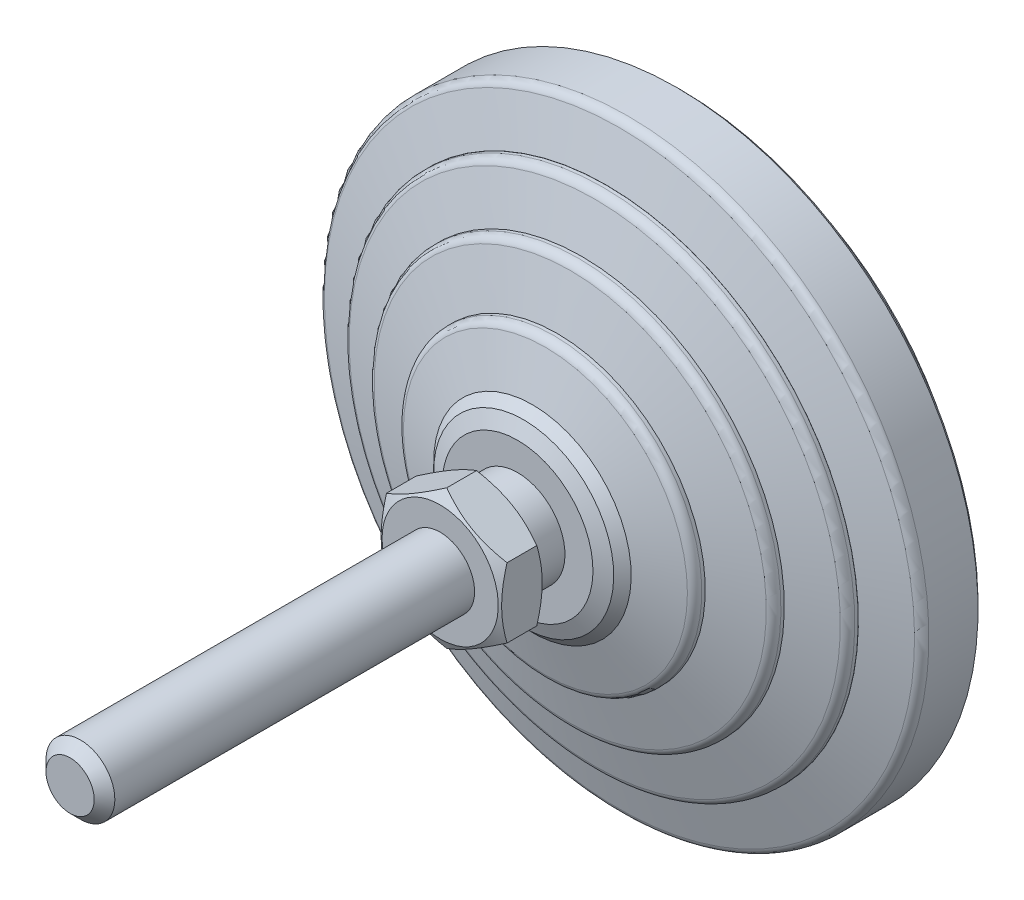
ISO-10303-21;
HEADER;
FILE_DESCRIPTION(('STEP AP214'),'2;1');
FILE_NAME('part.step','',(''),(''),'','','');
FILE_SCHEMA(('AUTOMOTIVE_DESIGN { 1 0 10303 214 1 1 1 1 }'));
ENDSEC;
DATA;
#1=APPLICATION_CONTEXT('core data for automotive mechanical design processes');
#2=APPLICATION_PROTOCOL_DEFINITION('international standard','automotive_design',2000,#1);
#3=PRODUCT_CONTEXT('',#1,'mechanical');
#4=PRODUCT('Part','Part','',(#3));
#5=PRODUCT_RELATED_PRODUCT_CATEGORY('part','',(#4));
#6=PRODUCT_DEFINITION_FORMATION('','',#4);
#7=PRODUCT_DEFINITION_CONTEXT('part definition',#1,'design');
#8=PRODUCT_DEFINITION('design','',#6,#7);
#9=PRODUCT_DEFINITION_SHAPE('','',#8);
#10=(LENGTH_UNIT() NAMED_UNIT(*) SI_UNIT(.MILLI.,.METRE.));
#11=(NAMED_UNIT(*) PLANE_ANGLE_UNIT() SI_UNIT($,.RADIAN.));
#12=(NAMED_UNIT(*) SI_UNIT($,.STERADIAN.) SOLID_ANGLE_UNIT());
#13=UNCERTAINTY_MEASURE_WITH_UNIT(LENGTH_MEASURE(1.E-05),#10,'distance_accuracy_value','');
#14=(GEOMETRIC_REPRESENTATION_CONTEXT(3) GLOBAL_UNCERTAINTY_ASSIGNED_CONTEXT((#13)) GLOBAL_UNIT_ASSIGNED_CONTEXT((#10,
#11,#12)) REPRESENTATION_CONTEXT('',''));
#15=CARTESIAN_POINT('',(0.,0.,0.));
#16=DIRECTION('',(0.,0.,1.));
#17=DIRECTION('',(1.,0.,0.));
#18=AXIS2_PLACEMENT_3D('',#15,#16,#17);
#19=CARTESIAN_POINT('',(-5.49999999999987,0.,26.));
#20=DIRECTION('',(0.,0.,1.));
#21=DIRECTION('',(0.,-1.,0.));
#22=AXIS2_PLACEMENT_3D('',#19,#20,#21);
#23=PLANE('',#22);
#24=CARTESIAN_POINT('',(0.,0.,26.));
#25=DIRECTION('',(0.,0.,-1.));
#26=DIRECTION('',(-1.,0.,0.));
#27=AXIS2_PLACEMENT_3D('',#24,#25,#26);
#28=CIRCLE('',#27,6.75);
#29=CARTESIAN_POINT('',(-6.75,0.,26.));
#30=VERTEX_POINT('',#29);
#31=EDGE_CURVE('E596',#30,#30,#28,.T.);
#32=ORIENTED_EDGE('',*,*,#31,.T.);
#33=EDGE_LOOP('',(#32));
#34=FACE_BOUND('',#33,.T.);
#35=CARTESIAN_POINT('',(0.,0.,26.));
#36=DIRECTION('',(0.,0.,-1.));
#37=DIRECTION('',(0.,1.,0.));
#38=AXIS2_PLACEMENT_3D('',#35,#36,#37);
#39=CIRCLE('',#38,5.49999999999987);
#40=CARTESIAN_POINT('',(0.,5.49999999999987,26.));
#41=VERTEX_POINT('',#40);
#42=EDGE_CURVE('E156',#41,#41,#39,.T.);
#43=ORIENTED_EDGE('',*,*,#42,.F.);
#44=EDGE_LOOP('',(#43));
#45=FACE_BOUND('',#44,.T.);
#46=ADVANCED_FACE('F14',(#34,#45),#23,.F.);
#47=CARTESIAN_POINT('',(0.,0.,0.));
#48=DIRECTION('',(0.,0.,-1.));
#49=DIRECTION('',(0.,1.,0.));
#50=AXIS2_PLACEMENT_3D('',#47,#48,#49);
#51=CYLINDRICAL_SURFACE('',#50,5.49999999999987);
#52=CARTESIAN_POINT('',(0.,0.,22.));
#53=DIRECTION('',(0.,0.,-1.));
#54=DIRECTION('',(0.,1.,0.));
#55=AXIS2_PLACEMENT_3D('',#52,#53,#54);
#56=CIRCLE('',#55,5.49999999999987);
#57=CARTESIAN_POINT('',(0.,5.49999999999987,22.));
#58=VERTEX_POINT('',#57);
#59=EDGE_CURVE('E153',#58,#58,#56,.T.);
#60=ORIENTED_EDGE('',*,*,#59,.F.);
#61=EDGE_LOOP('',(#60));
#62=FACE_BOUND('',#61,.T.);
#63=ORIENTED_EDGE('',*,*,#42,.T.);
#64=EDGE_LOOP('',(#63));
#65=FACE_BOUND('',#64,.T.);
#66=ADVANCED_FACE('F180',(#62,#65),#51,.T.);
#67=CARTESIAN_POINT('',(-8.7540983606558,0.,22.));
#68=DIRECTION('',(0.,0.,-1.));
#69=DIRECTION('',(0.,1.,0.));
#70=AXIS2_PLACEMENT_3D('',#67,#68,#69);
#71=PLANE('',#70);
#72=CARTESIAN_POINT('',(0.,0.,22.));
#73=DIRECTION('',(0.,0.,-1.));
#74=DIRECTION('',(0.,1.,0.));
#75=AXIS2_PLACEMENT_3D('',#72,#73,#74);
#76=CIRCLE('',#75,8.7540983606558);
#77=CARTESIAN_POINT('',(0.,8.7540983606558,22.));
#78=VERTEX_POINT('',#77);
#79=EDGE_CURVE('E150',#78,#78,#76,.T.);
#80=ORIENTED_EDGE('',*,*,#79,.F.);
#81=EDGE_LOOP('',(#80));
#82=FACE_BOUND('',#81,.T.);
#83=ORIENTED_EDGE('',*,*,#59,.T.);
#84=EDGE_LOOP('',(#83));
#85=FACE_BOUND('',#84,.T.);
#86=ADVANCED_FACE('F187',(#82,#85),#71,.F.);
#87=CARTESIAN_POINT('',(0.,0.,22.));
#88=DIRECTION('',(0.,0.,-1.));
#89=DIRECTION('',(0.,1.,0.));
#90=AXIS2_PLACEMENT_3D('',#87,#88,#89);
#91=CONICAL_SURFACE('',#90,8.7540983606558,1.17809724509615);
#92=CARTESIAN_POINT('',(0.,0.,21.2928932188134));
#93=DIRECTION('',(0.,0.,-1.));
#94=DIRECTION('',(0.,1.,0.));
#95=AXIS2_PLACEMENT_3D('',#92,#93,#94);
#96=CIRCLE('',#95,10.4612051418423);
#97=CARTESIAN_POINT('',(0.,10.4612051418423,21.2928932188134));
#98=VERTEX_POINT('',#97);
#99=EDGE_CURVE('E147',#98,#98,#96,.T.);
#100=ORIENTED_EDGE('',*,*,#99,.F.);
#101=EDGE_LOOP('',(#100));
#102=FACE_BOUND('',#101,.T.);
#103=ORIENTED_EDGE('',*,*,#79,.T.);
#104=EDGE_LOOP('',(#103));
#105=FACE_BOUND('',#104,.T.);
#106=ADVANCED_FACE('F459',(#102,#105),#91,.T.);
#107=CARTESIAN_POINT('',(0.,0.,21.2928932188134));
#108=DIRECTION('',(0.,0.,-1.));
#109=DIRECTION('',(0.,1.,0.));
#110=AXIS2_PLACEMENT_3D('',#107,#108,#109);
#111=CONICAL_SURFACE('',#110,10.4612051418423,0.785398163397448);
#112=CARTESIAN_POINT('',(0.,0.,20.2786885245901));
#113=DIRECTION('',(0.,0.,-1.));
#114=DIRECTION('',(0.,1.,0.));
#115=AXIS2_PLACEMENT_3D('',#112,#113,#114);
#116=CIRCLE('',#115,11.4754098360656);
#117=CARTESIAN_POINT('',(0.,11.4754098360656,20.2786885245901));
#118=VERTEX_POINT('',#117);
#119=EDGE_CURVE('E144',#118,#118,#116,.T.);
#120=ORIENTED_EDGE('',*,*,#119,.F.);
#121=EDGE_LOOP('',(#120));
#122=FACE_BOUND('',#121,.T.);
#123=ORIENTED_EDGE('',*,*,#99,.T.);
#124=EDGE_LOOP('',(#123));
#125=FACE_BOUND('',#124,.T.);
#126=ADVANCED_FACE('F449',(#122,#125),#111,.T.);
#127=CARTESIAN_POINT('',(0.,0.,20.2786885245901));
#128=DIRECTION('',(0.,0.,-1.));
#129=DIRECTION('',(0.,1.,0.));
#130=AXIS2_PLACEMENT_3D('',#127,#128,#129);
#131=CONICAL_SURFACE('',#130,11.4754098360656,1.27933953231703);
#132=CARTESIAN_POINT('',(0.,0.,18.7711726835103));
#133=DIRECTION('',(0.,0.,-1.));
#134=DIRECTION('',(0.,1.,0.));
#135=AXIS2_PLACEMENT_3D('',#132,#133,#134);
#136=CIRCLE('',#135,16.5004626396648);
#137=CARTESIAN_POINT('',(0.,16.5004626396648,18.7711726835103));
#138=VERTEX_POINT('',#137);
#139=EDGE_CURVE('E141',#138,#138,#136,.T.);
#140=ORIENTED_EDGE('',*,*,#139,.F.);
#141=EDGE_LOOP('',(#140));
#142=FACE_BOUND('',#141,.T.);
#143=ORIENTED_EDGE('',*,*,#119,.T.);
#144=EDGE_LOOP('',(#143));
#145=FACE_BOUND('',#144,.T.);
#146=ADVANCED_FACE('F439',(#142,#145),#131,.T.);
#147=CARTESIAN_POINT('',(0.,0.,17.8133463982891));
#148=DIRECTION('',(0.,0.,-1.));
#149=DIRECTION('',(0.,1.,0.));
#150=AXIS2_PLACEMENT_3D('',#147,#148,#149);
#151=TOROIDAL_SURFACE('',#150,16.2131147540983,1.);
#152=CARTESIAN_POINT('',(0.,0.,17.8133463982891));
#153=DIRECTION('',(0.,0.,-1.));
#154=DIRECTION('',(0.,1.,0.));
#155=AXIS2_PLACEMENT_3D('',#152,#153,#154);
#156=CIRCLE('',#155,17.2131147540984);
#157=CARTESIAN_POINT('',(0.,17.2131147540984,17.8133463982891));
#158=VERTEX_POINT('',#157);
#159=EDGE_CURVE('E138',#158,#158,#156,.T.);
#160=ORIENTED_EDGE('',*,*,#159,.F.);
#161=EDGE_LOOP('',(#160));
#162=FACE_BOUND('',#161,.T.);
#163=ORIENTED_EDGE('',*,*,#139,.T.);
#164=EDGE_LOOP('',(#163));
#165=FACE_BOUND('',#164,.T.);
#166=ADVANCED_FACE('F429',(#162,#165),#151,.T.);
#167=CARTESIAN_POINT('',(0.,0.,0.));
#168=DIRECTION('',(0.,0.,-1.));
#169=DIRECTION('',(0.,1.,0.));
#170=AXIS2_PLACEMENT_3D('',#167,#168,#169);
#171=CYLINDRICAL_SURFACE('',#170,17.2131147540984);
#172=CARTESIAN_POINT('',(0.,0.,17.4098360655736));
#173=DIRECTION('',(0.,0.,-1.));
#174=DIRECTION('',(0.,1.,0.));
#175=AXIS2_PLACEMENT_3D('',#172,#173,#174);
#176=CIRCLE('',#175,17.2131147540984);
#177=CARTESIAN_POINT('',(0.,17.2131147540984,17.4098360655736));
#178=VERTEX_POINT('',#177);
#179=EDGE_CURVE('E135',#178,#178,#176,.T.);
#180=ORIENTED_EDGE('',*,*,#179,.F.);
#181=EDGE_LOOP('',(#180));
#182=FACE_BOUND('',#181,.T.);
#183=ORIENTED_EDGE('',*,*,#159,.T.);
#184=EDGE_LOOP('',(#183));
#185=FACE_BOUND('',#184,.T.);
#186=ADVANCED_FACE('F419',(#182,#185),#171,.T.);
#187=CARTESIAN_POINT('',(0.,0.,17.4098360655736));
#188=DIRECTION('',(0.,0.,-1.));
#189=DIRECTION('',(0.,1.,0.));
#190=AXIS2_PLACEMENT_3D('',#187,#188,#189);
#191=CONICAL_SURFACE('',#190,17.2131147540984,1.30454427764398);
#192=CARTESIAN_POINT('',(0.,0.,15.8894925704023));
#193=DIRECTION('',(0.,0.,-1.));
#194=DIRECTION('',(0.,1.,0.));
#195=AXIS2_PLACEMENT_3D('',#192,#193,#194);
#196=CIRCLE('',#195,22.7877075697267);
#197=CARTESIAN_POINT('',(0.,22.7877075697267,15.8894925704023));
#198=VERTEX_POINT('',#197);
#199=EDGE_CURVE('E132',#198,#198,#196,.T.);
#200=ORIENTED_EDGE('',*,*,#199,.F.);
#201=EDGE_LOOP('',(#200));
#202=FACE_BOUND('',#201,.T.);
#203=ORIENTED_EDGE('',*,*,#179,.T.);
#204=EDGE_LOOP('',(#203));
#205=FACE_BOUND('',#204,.T.);
#206=ADVANCED_FACE('F409',(#202,#205),#191,.T.);
#207=CARTESIAN_POINT('',(0.,0.,14.9247287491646));
#208=DIRECTION('',(0.,0.,-1.));
#209=DIRECTION('',(0.,1.,0.));
#210=AXIS2_PLACEMENT_3D('',#207,#208,#209);
#211=TOROIDAL_SURFACE('',#210,22.5245901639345,1.);
#212=CARTESIAN_POINT('',(0.,0.,14.9247287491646));
#213=DIRECTION('',(0.,0.,-1.));
#214=DIRECTION('',(0.,1.,0.));
#215=AXIS2_PLACEMENT_3D('',#212,#213,#214);
#216=CIRCLE('',#215,23.5245901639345);
#217=CARTESIAN_POINT('',(0.,23.5245901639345,14.9247287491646));
#218=VERTEX_POINT('',#217);
#219=EDGE_CURVE('E129',#218,#218,#216,.T.);
#220=ORIENTED_EDGE('',*,*,#219,.F.);
#221=EDGE_LOOP('',(#220));
#222=FACE_BOUND('',#221,.T.);
#223=ORIENTED_EDGE('',*,*,#199,.T.);
#224=EDGE_LOOP('',(#223));
#225=FACE_BOUND('',#224,.T.);
#226=ADVANCED_FACE('F399',(#222,#225),#211,.T.);
#227=CARTESIAN_POINT('',(0.,0.,0.));
#228=DIRECTION('',(0.,0.,-1.));
#229=DIRECTION('',(0.,1.,0.));
#230=AXIS2_PLACEMENT_3D('',#227,#228,#229);
#231=CYLINDRICAL_SURFACE('',#230,23.5245901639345);
#232=CARTESIAN_POINT('',(0.,0.,14.5409836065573));
#233=DIRECTION('',(0.,0.,-1.));
#234=DIRECTION('',(0.,1.,0.));
#235=AXIS2_PLACEMENT_3D('',#232,#233,#234);
#236=CIRCLE('',#235,23.5245901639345);
#237=CARTESIAN_POINT('',(0.,23.5245901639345,14.5409836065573));
#238=VERTEX_POINT('',#237);
#239=EDGE_CURVE('E126',#238,#238,#236,.T.);
#240=ORIENTED_EDGE('',*,*,#239,.F.);
#241=EDGE_LOOP('',(#240));
#242=FACE_BOUND('',#241,.T.);
#243=ORIENTED_EDGE('',*,*,#219,.T.);
#244=EDGE_LOOP('',(#243));
#245=FACE_BOUND('',#244,.T.);
#246=ADVANCED_FACE('F389',(#242,#245),#231,.T.);
#247=CARTESIAN_POINT('',(0.,0.,14.5409836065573));
#248=DIRECTION('',(0.,0.,-1.));
#249=DIRECTION('',(0.,1.,0.));
#250=AXIS2_PLACEMENT_3D('',#247,#248,#249);
#251=CONICAL_SURFACE('',#250,23.5245901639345,1.27871257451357);
#252=CARTESIAN_POINT('',(0.,0.,13.0337743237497));
#253=DIRECTION('',(0.,0.,-1.));
#254=DIRECTION('',(0.,1.,0.));
#255=AXIS2_PLACEMENT_3D('',#252,#253,#254);
#256=CIRCLE('',#255,28.5372004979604);
#257=CARTESIAN_POINT('',(0.,28.5372004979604,13.0337743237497));
#258=VERTEX_POINT('',#257);
#259=EDGE_CURVE('E123',#258,#258,#256,.T.);
#260=ORIENTED_EDGE('',*,*,#259,.F.);
#261=EDGE_LOOP('',(#260));
#262=FACE_BOUND('',#261,.T.);
#263=ORIENTED_EDGE('',*,*,#239,.T.);
#264=EDGE_LOOP('',(#263));
#265=FACE_BOUND('',#264,.T.);
#266=ADVANCED_FACE('F379',(#262,#265),#251,.T.);
#267=CARTESIAN_POINT('',(0.,0.,12.0761283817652));
#268=DIRECTION('',(0.,0.,-1.));
#269=DIRECTION('',(0.,1.,0.));
#270=AXIS2_PLACEMENT_3D('',#267,#268,#269);
#271=TOROIDAL_SURFACE('',#270,28.2492521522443,1.);
#272=CARTESIAN_POINT('',(0.,0.,12.0761283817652));
#273=DIRECTION('',(0.,0.,-1.));
#274=DIRECTION('',(0.,1.,0.));
#275=AXIS2_PLACEMENT_3D('',#272,#273,#274);
#276=CIRCLE('',#275,29.2492521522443);
#277=CARTESIAN_POINT('',(0.,29.2492521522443,12.0761283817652));
#278=VERTEX_POINT('',#277);
#279=EDGE_CURVE('E120',#278,#278,#276,.T.);
#280=ORIENTED_EDGE('',*,*,#279,.F.);
#281=EDGE_LOOP('',(#280));
#282=FACE_BOUND('',#281,.T.);
#283=ORIENTED_EDGE('',*,*,#259,.T.);
#284=EDGE_LOOP('',(#283));
#285=FACE_BOUND('',#284,.T.);
#286=ADVANCED_FACE('F369',(#282,#285),#271,.T.);
#287=CARTESIAN_POINT('',(0.,0.,0.));
#288=DIRECTION('',(0.,0.,-1.));
#289=DIRECTION('',(0.,1.,0.));
#290=AXIS2_PLACEMENT_3D('',#287,#288,#289);
#291=CYLINDRICAL_SURFACE('',#290,29.2492521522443);
#292=CARTESIAN_POINT('',(0.,0.,11.6721311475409));
#293=DIRECTION('',(0.,0.,-1.));
#294=DIRECTION('',(0.,1.,0.));
#295=AXIS2_PLACEMENT_3D('',#292,#293,#294);
#296=CIRCLE('',#295,29.2492521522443);
#297=CARTESIAN_POINT('',(0.,29.2492521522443,11.6721311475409));
#298=VERTEX_POINT('',#297);
#299=EDGE_CURVE('E117',#298,#298,#296,.T.);
#300=ORIENTED_EDGE('',*,*,#299,.F.);
#301=EDGE_LOOP('',(#300));
#302=FACE_BOUND('',#301,.T.);
#303=ORIENTED_EDGE('',*,*,#279,.T.);
#304=EDGE_LOOP('',(#303));
#305=FACE_BOUND('',#304,.T.);
#306=ADVANCED_FACE('F359',(#302,#305),#291,.T.);
#307=CARTESIAN_POINT('',(-29.2622950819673,0.,11.6721311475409));
#308=DIRECTION('',(0.,0.,-1.));
#309=DIRECTION('',(0.,1.,0.));
#310=AXIS2_PLACEMENT_3D('',#307,#308,#309);
#311=PLANE('',#310);
#312=CARTESIAN_POINT('',(0.,0.,11.6721311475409));
#313=DIRECTION('',(0.,0.,-1.));
#314=DIRECTION('',(0.,1.,0.));
#315=AXIS2_PLACEMENT_3D('',#312,#313,#314);
#316=CIRCLE('',#315,29.2622950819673);
#317=CARTESIAN_POINT('',(0.,29.2622950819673,11.6721311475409));
#318=VERTEX_POINT('',#317);
#319=EDGE_CURVE('E114',#318,#318,#316,.T.);
#320=ORIENTED_EDGE('',*,*,#319,.F.);
#321=EDGE_LOOP('',(#320));
#322=FACE_BOUND('',#321,.T.);
#323=ORIENTED_EDGE('',*,*,#299,.T.);
#324=EDGE_LOOP('',(#323));
#325=FACE_BOUND('',#324,.T.);
#326=ADVANCED_FACE('F349',(#322,#325),#311,.F.);
#327=CARTESIAN_POINT('',(0.,0.,11.6721311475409));
#328=DIRECTION('',(0.,0.,-1.));
#329=DIRECTION('',(0.,1.,0.));
#330=AXIS2_PLACEMENT_3D('',#327,#328,#329);
#331=CONICAL_SURFACE('',#330,29.2622950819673,1.27933953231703);
#332=CARTESIAN_POINT('',(0.,0.,10.1646153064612));
#333=DIRECTION('',(0.,0.,-1.));
#334=DIRECTION('',(0.,1.,0.));
#335=AXIS2_PLACEMENT_3D('',#332,#333,#334);
#336=CIRCLE('',#335,34.2873478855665);
#337=CARTESIAN_POINT('',(0.,34.2873478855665,10.1646153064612));
#338=VERTEX_POINT('',#337);
#339=EDGE_CURVE('E111',#338,#338,#336,.T.);
#340=ORIENTED_EDGE('',*,*,#339,.F.);
#341=EDGE_LOOP('',(#340));
#342=FACE_BOUND('',#341,.T.);
#343=ORIENTED_EDGE('',*,*,#319,.T.);
#344=EDGE_LOOP('',(#343));
#345=FACE_BOUND('',#344,.T.);
#346=ADVANCED_FACE('F339',(#342,#345),#331,.T.);
#347=CARTESIAN_POINT('',(0.,0.,9.20678902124));
#348=DIRECTION('',(0.,0.,-1.));
#349=DIRECTION('',(0.,1.,0.));
#350=AXIS2_PLACEMENT_3D('',#347,#348,#349);
#351=TOROIDAL_SURFACE('',#350,34.,1.);
#352=CARTESIAN_POINT('',(0.,0.,9.20678902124));
#353=DIRECTION('',(0.,0.,-1.));
#354=DIRECTION('',(0.,1.,0.));
#355=AXIS2_PLACEMENT_3D('',#352,#353,#354);
#356=CIRCLE('',#355,35.);
#357=CARTESIAN_POINT('',(0.,35.,9.20678902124));
#358=VERTEX_POINT('',#357);
#359=EDGE_CURVE('E108',#358,#358,#356,.T.);
#360=ORIENTED_EDGE('',*,*,#359,.F.);
#361=EDGE_LOOP('',(#360));
#362=FACE_BOUND('',#361,.T.);
#363=ORIENTED_EDGE('',*,*,#339,.T.);
#364=EDGE_LOOP('',(#363));
#365=FACE_BOUND('',#364,.T.);
#366=ADVANCED_FACE('F329',(#362,#365),#351,.T.);
#367=CARTESIAN_POINT('',(0.,0.,0.));
#368=DIRECTION('',(0.,0.,-1.));
#369=DIRECTION('',(0.,1.,0.));
#370=AXIS2_PLACEMENT_3D('',#367,#368,#369);
#371=CYLINDRICAL_SURFACE('',#370,35.);
#372=CARTESIAN_POINT('',(0.,0.,3.5));
#373=DIRECTION('',(0.,0.,-1.));
#374=DIRECTION('',(0.,1.,0.));
#375=AXIS2_PLACEMENT_3D('',#372,#373,#374);
#376=CIRCLE('',#375,35.);
#377=CARTESIAN_POINT('',(0.,35.,3.5));
#378=VERTEX_POINT('',#377);
#379=EDGE_CURVE('E105',#378,#378,#376,.T.);
#380=ORIENTED_EDGE('',*,*,#379,.F.);
#381=EDGE_LOOP('',(#380));
#382=FACE_BOUND('',#381,.T.);
#383=ORIENTED_EDGE('',*,*,#359,.T.);
#384=EDGE_LOOP('',(#383));
#385=FACE_BOUND('',#384,.T.);
#386=ADVANCED_FACE('F319',(#382,#385),#371,.T.);
#387=CARTESIAN_POINT('',(0.,0.,3.5));
#388=DIRECTION('',(0.,0.,1.));
#389=DIRECTION('',(0.,-1.,0.));
#390=AXIS2_PLACEMENT_3D('',#387,#388,#389);
#391=CONICAL_SURFACE('',#390,35.,0.785398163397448);
#392=CARTESIAN_POINT('',(0.,0.,3.));
#393=DIRECTION('',(0.,0.,-1.));
#394=DIRECTION('',(0.,1.,0.));
#395=AXIS2_PLACEMENT_3D('',#392,#393,#394);
#396=CIRCLE('',#395,34.5);
#397=CARTESIAN_POINT('',(0.,34.5,3.));
#398=VERTEX_POINT('',#397);
#399=EDGE_CURVE('E102',#398,#398,#396,.T.);
#400=ORIENTED_EDGE('',*,*,#399,.F.);
#401=EDGE_LOOP('',(#400));
#402=FACE_BOUND('',#401,.T.);
#403=ORIENTED_EDGE('',*,*,#379,.T.);
#404=EDGE_LOOP('',(#403));
#405=FACE_BOUND('',#404,.T.);
#406=ADVANCED_FACE('F309',(#402,#405),#391,.T.);
#407=CARTESIAN_POINT('',(-34.5,0.,3.));
#408=DIRECTION('',(0.,0.,1.));
#409=DIRECTION('',(0.,-1.,0.));
#410=AXIS2_PLACEMENT_3D('',#407,#408,#409);
#411=PLANE('',#410);
#412=CARTESIAN_POINT('',(0.,0.,3.));
#413=DIRECTION('',(0.,0.,-1.));
#414=DIRECTION('',(0.,1.,0.));
#415=AXIS2_PLACEMENT_3D('',#412,#413,#414);
#416=CIRCLE('',#415,30.4098360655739);
#417=CARTESIAN_POINT('',(0.,30.4098360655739,3.));
#418=VERTEX_POINT('',#417);
#419=EDGE_CURVE('E99',#418,#418,#416,.T.);
#420=ORIENTED_EDGE('',*,*,#419,.F.);
#421=EDGE_LOOP('',(#420));
#422=FACE_BOUND('',#421,.T.);
#423=ORIENTED_EDGE('',*,*,#399,.T.);
#424=EDGE_LOOP('',(#423));
#425=FACE_BOUND('',#424,.T.);
#426=ADVANCED_FACE('F299',(#422,#425),#411,.F.);
#427=CARTESIAN_POINT('',(0.,0.,0.));
#428=DIRECTION('',(0.,0.,-1.));
#429=DIRECTION('',(0.,1.,0.));
#430=AXIS2_PLACEMENT_3D('',#427,#428,#429);
#431=CYLINDRICAL_SURFACE('',#430,30.4098360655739);
#432=CARTESIAN_POINT('',(0.,0.,0.));
#433=DIRECTION('',(0.,0.,-1.));
#434=DIRECTION('',(0.,1.,0.));
#435=AXIS2_PLACEMENT_3D('',#432,#433,#434);
#436=CIRCLE('',#435,30.4098360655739);
#437=CARTESIAN_POINT('',(0.,30.4098360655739,0.));
#438=VERTEX_POINT('',#437);
#439=EDGE_CURVE('E96',#438,#438,#436,.T.);
#440=ORIENTED_EDGE('',*,*,#439,.F.);
#441=EDGE_LOOP('',(#440));
#442=FACE_BOUND('',#441,.T.);
#443=ORIENTED_EDGE('',*,*,#419,.T.);
#444=EDGE_LOOP('',(#443));
#445=FACE_BOUND('',#444,.T.);
#446=ADVANCED_FACE('F288',(#442,#445),#431,.T.);
#447=CARTESIAN_POINT('',(-30.4098360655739,0.,0.));
#448=DIRECTION('',(0.,0.,1.));
#449=DIRECTION('',(0.,-1.,0.));
#450=AXIS2_PLACEMENT_3D('',#447,#448,#449);
#451=PLANE('',#450);
#452=ORIENTED_EDGE('',*,*,#439,.T.);
#453=EDGE_LOOP('',(#452));
#454=FACE_BOUND('',#453,.T.);
#455=ADVANCED_FACE('F178',(#454),#451,.F.);
#456=CARTESIAN_POINT('',(0.,0.,27.389313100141));
#457=DIRECTION('',(0.,0.,1.));
#458=DIRECTION('',(1.,0.,0.));
#459=AXIS2_PLACEMENT_3D('',#456,#457,#458);
#460=CONICAL_SURFACE('',#459,9.15636087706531,1.0471975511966);
#461=CARTESIAN_POINT('',(0.257800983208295,-8.23174523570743,26.8578161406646));
#462=CARTESIAN_POINT('',(-0.0688568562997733,-8.04314924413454,26.7430671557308));
#463=CARTESIAN_POINT('',(-0.398569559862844,-7.85278952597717,26.6380408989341));
#464=CARTESIAN_POINT('',(-1.06437546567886,-7.46838630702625,26.4536488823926));
#465=CARTESIAN_POINT('',(-1.40048554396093,-7.27433306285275,26.3743652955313));
#466=CARTESIAN_POINT('',(-1.90323243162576,-6.98407201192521,26.2808549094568));
#467=CARTESIAN_POINT('',(-2.06812090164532,-6.88887360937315,26.2541408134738));
#468=CARTESIAN_POINT('',(-2.39876137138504,-6.69797824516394,26.2090631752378));
#469=CARTESIAN_POINT('',(-2.5645133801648,-6.60228127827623,26.1906997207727));
#470=CARTESIAN_POINT('',(-2.89631107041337,-6.41071779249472,26.1628473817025));
#471=CARTESIAN_POINT('',(-3.06235584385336,-6.31485179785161,26.153344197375));
#472=CARTESIAN_POINT('',(-3.39464993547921,-6.1230017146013,26.1434329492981));
#473=CARTESIAN_POINT('',(-3.56089925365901,-6.0270176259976,26.1430248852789));
#474=CARTESIAN_POINT('',(-3.90358105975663,-5.82917019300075,26.1515765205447));
#475=CARTESIAN_POINT('',(-4.08000269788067,-5.72731311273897,26.1611214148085));
#476=CARTESIAN_POINT('',(-4.43222742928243,-5.52395606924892,26.1901828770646));
#477=CARTESIAN_POINT('',(-4.60803050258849,-5.4224561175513,26.2096997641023));
#478=CARTESIAN_POINT('',(-4.95898672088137,-5.21983145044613,26.258155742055));
#479=CARTESIAN_POINT('',(-5.13413802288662,-5.11870779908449,26.2871124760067));
#480=CARTESIAN_POINT('',(-5.48321135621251,-4.91717021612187,26.3536446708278));
#481=CARTESIAN_POINT('',(-5.65713329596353,-4.81675633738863,26.3912207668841));
#482=CARTESIAN_POINT('',(-6.00911383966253,-4.6135402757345,26.4754162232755));
#483=CARTESIAN_POINT('',(-6.18712721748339,-4.51076420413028,26.5222860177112));
#484=CARTESIAN_POINT('',(-6.54162137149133,-4.30609690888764,26.6232482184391));
#485=CARTESIAN_POINT('',(-6.71810198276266,-4.20420578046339,26.6773413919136));
#486=CARTESIAN_POINT('',(-7.06879737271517,-4.00173170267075,26.7915468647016));
#487=CARTESIAN_POINT('',(-7.24301850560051,-3.90114508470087,26.8516333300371));
#488=CARTESIAN_POINT('',(-7.58994246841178,-3.70084844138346,26.9771492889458));
#489=CARTESIAN_POINT('',(-7.76264584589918,-3.60113809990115,27.0425767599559));
#490=CARTESIAN_POINT('',(-7.93465983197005,-3.50182577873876,27.110267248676));
#491=B_SPLINE_CURVE_WITH_KNOTS('',3,(#461,#462,#463,#464,#465,#466,#467,#468,#469,#470,#471,
#472,#473,#474,#475,#476,#477,#478,#479,#480,#481,#482,#483,#484,#485,#486,#487,#488,#489,#490),
.UNSPECIFIED.,.F.,.F.,(4,2,2,2,2,2,2,2,2,2,2,2,2,2,4),(0.,1.18352540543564,2.37079241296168,
2.94740881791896,3.52403128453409,4.09972151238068,4.67541172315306,5.28696740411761,
5.89854265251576,6.5112675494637,7.12403761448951,7.75637273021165,8.38877505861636,
9.01856044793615,9.64810844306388),.UNSPECIFIED.);
#492=CARTESIAN_POINT('',(0.,-8.08290376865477,26.7695523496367));
#493=VERTEX_POINT('',#492);
#494=CARTESIAN_POINT('',(-7.,-4.04145188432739,26.7695523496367));
#495=VERTEX_POINT('',#494);
#496=EDGE_CURVE('E73',#493,#495,#491,.T.);
#497=ORIENTED_EDGE('',*,*,#496,.T.);
#498=CARTESIAN_POINT('',(-7.,-10.7846087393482,29.5259979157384));
#499=CARTESIAN_POINT('',(-7.,-10.4794608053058,29.3782616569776));
#500=CARTESIAN_POINT('',(-7.,-10.1736046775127,29.2319627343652));
#501=CARTESIAN_POINT('',(-7.,-9.56009912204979,28.943049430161));
#502=CARTESIAN_POINT('',(-7.,-9.25244941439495,28.8004356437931));
#503=CARTESIAN_POINT('',(-7.,-8.63336023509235,28.5189696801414));
#504=CARTESIAN_POINT('',(-7.,-8.32190920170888,28.3801428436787));
#505=CARTESIAN_POINT('',(-7.,-7.69650490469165,28.1082665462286));
#506=CARTESIAN_POINT('',(-7.,-7.38255176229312,27.9752168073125));
#507=CARTESIAN_POINT('',(-7.,-6.74179270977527,27.7123816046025));
#508=CARTESIAN_POINT('',(-7.,-6.41489138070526,27.5828274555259));
#509=CARTESIAN_POINT('',(-7.,-5.75723878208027,27.3336978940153));
#510=CARTESIAN_POINT('',(-7.,-5.42648708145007,27.2141236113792));
#511=CARTESIAN_POINT('',(-7.,-4.76124597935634,26.9881455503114));
#512=CARTESIAN_POINT('',(-7.,-4.42676594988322,26.881714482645));
#513=CARTESIAN_POINT('',(-7.,-3.75302109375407,26.685483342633));
#514=CARTESIAN_POINT('',(-7.,-3.41375783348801,26.5956779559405));
#515=CARTESIAN_POINT('',(-7.,-2.7320639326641,26.4375339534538));
#516=CARTESIAN_POINT('',(-7.,-2.3896603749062,26.3690817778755));
#517=CARTESIAN_POINT('',(-7.,-1.87299482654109,26.2854177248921));
#518=CARTESIAN_POINT('',(-7.,-1.70024970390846,26.2606975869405));
#519=CARTESIAN_POINT('',(-7.,-1.35392527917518,26.2180817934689));
#520=CARTESIAN_POINT('',(-7.,-1.18034605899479,26.2001854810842));
#521=CARTESIAN_POINT('',(-7.,-0.834822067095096,26.1717946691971));
#522=CARTESIAN_POINT('',(-7.,-0.66288488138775,26.1612081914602));
#523=CARTESIAN_POINT('',(-7.,-0.318717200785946,26.1473104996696));
#524=CARTESIAN_POINT('',(-7.,-0.146486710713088,26.1439991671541));
#525=CARTESIAN_POINT('',(-7.,0.197960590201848,26.1447306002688));
#526=CARTESIAN_POINT('',(-7.,0.37017740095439,26.1487734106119));
#527=CARTESIAN_POINT('',(-7.,0.714289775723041,26.1641155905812));
#528=CARTESIAN_POINT('',(-7.,0.886185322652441,26.1754153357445));
#529=CARTESIAN_POINT('',(-7.,1.30148664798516,26.2112455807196));
#530=CARTESIAN_POINT('',(-7.,1.54459117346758,26.2393403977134));
#531=CARTESIAN_POINT('',(-7.,2.02893730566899,26.3084951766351));
#532=CARTESIAN_POINT('',(-7.,2.270178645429,26.3495569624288));
#533=CARTESIAN_POINT('',(-7.,2.99086501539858,26.4900103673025));
#534=CARTESIAN_POINT('',(-7.,3.46699122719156,26.6066426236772));
#535=CARTESIAN_POINT('',(-7.,4.17883552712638,26.8081531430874));
#536=CARTESIAN_POINT('',(-7.,4.41826427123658,26.8806709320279));
#537=CARTESIAN_POINT('',(-7.,4.8947950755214,27.0330537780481));
#538=CARTESIAN_POINT('',(-7.,5.13189712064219,27.1129188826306));
#539=CARTESIAN_POINT('',(-7.,5.60385272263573,27.2787303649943));
#540=CARTESIAN_POINT('',(-7.,5.83870703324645,27.3646746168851));
#541=CARTESIAN_POINT('',(-7.,6.30648232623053,27.5416516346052));
#542=CARTESIAN_POINT('',(-7.,6.53940332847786,27.6326843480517));
#543=CARTESIAN_POINT('',(-7.,7.07745261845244,27.848664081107));
#544=CARTESIAN_POINT('',(-7.,7.38195060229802,27.9751781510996));
#545=CARTESIAN_POINT('',(-7.,7.98845648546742,28.2340567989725));
#546=CARTESIAN_POINT('',(-7.,8.29046424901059,28.3664216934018));
#547=CARTESIAN_POINT('',(-7.,8.89243284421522,28.6358589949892));
#548=CARTESIAN_POINT('',(-7.,9.1923932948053,28.7729322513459));
#549=CARTESIAN_POINT('',(-7.,9.79055539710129,29.0508705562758));
#550=CARTESIAN_POINT('',(-7.,10.0887570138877,29.1917356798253));
#551=CARTESIAN_POINT('',(-7.,10.6839699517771,29.4767024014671));
#552=CARTESIAN_POINT('',(-7.,10.9809798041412,29.6208070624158));
#553=CARTESIAN_POINT('',(-7.,11.5737427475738,29.9115806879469));
#554=CARTESIAN_POINT('',(-7.,11.8694958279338,30.0582496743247));
#555=CARTESIAN_POINT('',(-7.,12.7550915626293,30.5014022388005));
#556=CARTESIAN_POINT('',(-7.,13.3433426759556,30.8010661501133));
#557=CARTESIAN_POINT('',(-7.,14.4694773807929,31.3820284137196));
#558=CARTESIAN_POINT('',(-7.,15.0076017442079,31.6628620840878));
#559=CARTESIAN_POINT('',(-7.,16.0818425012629,32.2283822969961));
#560=CARTESIAN_POINT('',(-7.,16.6179588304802,32.5130689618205));
#561=CARTESIAN_POINT('',(-7.,17.6873721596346,33.0847237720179));
#562=CARTESIAN_POINT('',(-7.,18.22067281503,33.3716850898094));
#563=CARTESIAN_POINT('',(-7.,19.2859833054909,33.9479295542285));
#564=CARTESIAN_POINT('',(-7.,19.8179932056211,34.2372125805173));
#565=CARTESIAN_POINT('',(-7.,20.349524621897,34.5273662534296));
#566=B_SPLINE_CURVE_WITH_KNOTS('',3,(#498,#499,#500,#501,#502,#503,#504,#505,#506,#507,#508,
#509,#510,#511,#512,#513,#514,#515,#516,#517,#518,#519,#520,#521,#522,#523,#524,#525,#526,#527,
#528,#529,#530,#531,#532,#533,#534,#535,#536,#537,#538,#539,#540,#541,#542,#543,#544,#545,#546,
#547,#548,#549,#550,#551,#552,#553,#554,#555,#556,#557,#558,#559,#560,#561,#562,#563,#564,#565),
.UNSPECIFIED.,.F.,.F.,(4,2,2,2,2,2,2,2,2,2,2,2,2,2,2,2,2,2,2,2,2,2,2,2,2,2,2,2,2,2,2,2,2,4),(0.,
1.01710242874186,2.03436812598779,3.05729316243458,4.08016893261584,5.13495430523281,
6.18985892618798,7.24253504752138,8.29487410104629,9.34151727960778,9.86491838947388,
10.3882691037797,10.9049083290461,11.4215391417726,11.9381730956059,12.4548337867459,
13.1885853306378,13.9224401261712,15.3909934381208,16.1414428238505,16.8918970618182,
17.6420901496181,18.3922755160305,19.3813978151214,20.3705736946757,21.3599289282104,
22.3493037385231,23.3396569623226,24.3300186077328,26.3105022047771,28.1314765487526,
29.9525088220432,31.7693151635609,33.5860279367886),.UNSPECIFIED.);
#567=CARTESIAN_POINT('',(-7.,4.04145188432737,26.7695523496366));
#568=VERTEX_POINT('',#567);
#569=EDGE_CURVE('E81',#495,#568,#566,.T.);
#570=ORIENTED_EDGE('',*,*,#569,.T.);
#571=CARTESIAN_POINT('',(-12.6594583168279,0.773962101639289,29.425474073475));
#572=CARTESIAN_POINT('',(-12.3914077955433,0.92872114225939,29.2765020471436));
#573=CARTESIAN_POINT('',(-12.122702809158,1.08385803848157,29.1290700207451));
#574=CARTESIAN_POINT('',(-11.5836233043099,1.39509573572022,28.8381827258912));
#575=CARTESIAN_POINT('',(-11.3132484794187,1.55119671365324,28.6947282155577));
#576=CARTESIAN_POINT('',(-10.7688550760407,1.86550239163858,28.4118587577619));
#577=CARTESIAN_POINT('',(-10.4948242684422,2.02371415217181,28.2724750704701));
#578=CARTESIAN_POINT('',(-9.94442603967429,2.34148671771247,28.000026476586));
#579=CARTESIAN_POINT('',(-9.66805875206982,2.50104744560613,27.8669612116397));
#580=CARTESIAN_POINT('',(-9.11004481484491,2.82321694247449,27.6077196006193));
#581=CARTESIAN_POINT('',(-8.82837308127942,2.98584019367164,27.4816148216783));
#582=CARTESIAN_POINT('',(-8.26160369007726,3.31306465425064,27.239914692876));
#583=CARTESIAN_POINT('',(-7.97650562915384,3.47766609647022,27.1243205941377));
#584=CARTESIAN_POINT('',(-7.40309327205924,3.80872587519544,26.9069884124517));
#585=CARTESIAN_POINT('',(-7.1147884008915,3.97517877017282,26.8052175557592));
#586=CARTESIAN_POINT('',(-6.53405222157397,4.31046695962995,26.6190637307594));
#587=CARTESIAN_POINT('',(-6.24162237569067,4.47930140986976,26.534674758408));
#588=CARTESIAN_POINT('',(-5.65638712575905,4.81718713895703,26.3886518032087));
#589=CARTESIAN_POINT('',(-5.36363583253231,4.9862071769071,26.3267367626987));
#590=CARTESIAN_POINT('',(-4.92212028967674,5.24111629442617,26.2529628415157));
#591=CARTESIAN_POINT('',(-4.77453077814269,5.32632713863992,26.2315530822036));
#592=CARTESIAN_POINT('',(-4.47873599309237,5.49710433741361,26.1955242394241));
#593=CARTESIAN_POINT('',(-4.33053077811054,5.58267065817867,26.1809045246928));
#594=CARTESIAN_POINT('',(-4.03453664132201,5.75356295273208,26.1588397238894));
#595=CARTESIAN_POINT('',(-3.88674990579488,5.83888766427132,26.1513556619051));
#596=CARTESIAN_POINT('',(-3.59103548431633,6.00961846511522,26.1435930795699));
#597=CARTESIAN_POINT('',(-3.44310780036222,6.09502455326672,26.1433144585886));
#598=CARTESIAN_POINT('',(-3.14741106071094,6.26574514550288,26.1499692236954));
#599=CARTESIAN_POINT('',(-2.99964197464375,6.35105966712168,26.1569008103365));
#600=CARTESIAN_POINT('',(-2.70447599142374,6.52147382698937,26.1778122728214));
#601=CARTESIAN_POINT('',(-2.55707911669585,6.60657345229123,26.1917925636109));
#602=CARTESIAN_POINT('',(-2.19285813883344,6.81685653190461,26.234767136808));
#603=CARTESIAN_POINT('',(-1.97637994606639,6.94184027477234,26.2677404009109));
#604=CARTESIAN_POINT('',(-1.54526612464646,7.1907439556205,26.3469930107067));
#605=CARTESIAN_POINT('',(-1.33063080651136,7.31466371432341,26.3932745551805));
#606=CARTESIAN_POINT('',(-0.689040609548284,7.68508598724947,26.549739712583));
#607=CARTESIAN_POINT('',(-0.265258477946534,7.92975671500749,26.6774303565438));
#608=CARTESIAN_POINT('',(0.368256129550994,8.29551654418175,26.8954623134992));
#609=CARTESIAN_POINT('',(0.581339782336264,8.41854044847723,26.9735409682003));
#610=CARTESIAN_POINT('',(1.00544999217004,8.66340059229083,27.1369533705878));
#611=CARTESIAN_POINT('',(1.21647637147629,8.78523672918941,27.2222877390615));
#612=CARTESIAN_POINT('',(1.63541294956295,9.02710987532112,27.3984242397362));
#613=CARTESIAN_POINT('',(1.84333410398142,9.14715320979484,27.4891919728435));
#614=CARTESIAN_POINT('',(2.25744208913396,9.38623856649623,27.6756392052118));
#615=CARTESIAN_POINT('',(2.46362947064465,9.50528090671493,27.7713170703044));
#616=CARTESIAN_POINT('',(2.66909237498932,9.62390496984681,27.8689820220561));
#617=B_SPLINE_CURVE_WITH_KNOTS('',3,(#571,#572,#573,#574,#575,#576,#577,#578,#579,#580,#581,
#582,#583,#584,#585,#586,#587,#588,#589,#590,#591,#592,#593,#594,#595,#596,#597,#598,#599,#600,
#601,#602,#603,#604,#605,#606,#607,#608,#609,#610,#611,#612,#613,#614,#615,#616),.UNSPECIFIED.,
.F.,.F.,(4,2,2,2,2,2,2,2,2,2,2,2,2,2,2,2,2,2,2,2,2,2,4),(0.,1.03052338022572,2.0612418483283,
3.09847449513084,4.13564824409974,5.18202096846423,6.22851808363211,7.27248903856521,
8.31609877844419,9.34616673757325,9.86133621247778,10.376457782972,10.8887492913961,
11.4010336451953,11.9131901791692,12.4253768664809,13.1813404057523,13.9374289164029,
15.4525810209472,16.226945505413,17.0013763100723,17.7713375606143,18.5410441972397),.UNSPECIFIED.);
#618=CARTESIAN_POINT('',(0.,8.08290376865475,26.7695523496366));
#619=VERTEX_POINT('',#618);
#620=EDGE_CURVE('E551',#568,#619,#617,.T.);
#621=ORIENTED_EDGE('',*,*,#620,.T.);
#622=CARTESIAN_POINT('',(-0.940681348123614,8.62600639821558,27.11263843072));
#623=CARTESIAN_POINT('',(-0.768581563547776,8.52664454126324,27.0448543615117));
#624=CARTESIAN_POINT('',(-0.595792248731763,8.42688458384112,26.9793318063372));
#625=CARTESIAN_POINT('',(-0.248695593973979,8.2264882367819,26.8536230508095));
#626=CARTESIAN_POINT('',(-0.074387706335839,8.12585153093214,26.7934388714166));
#627=CARTESIAN_POINT('',(0.276484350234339,7.92327545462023,26.6790348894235));
#628=CARTESIAN_POINT('',(0.453054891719,7.82133240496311,26.6248409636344));
#629=CARTESIAN_POINT('',(0.80773098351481,7.61656006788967,26.5236761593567));
#630=CARTESIAN_POINT('',(0.985836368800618,7.51373087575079,26.4767045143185));
#631=CARTESIAN_POINT('',(1.33799792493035,7.31041030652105,26.3923097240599));
#632=CARTESIAN_POINT('',(1.51200875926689,7.20994510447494,26.3546359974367));
#633=CARTESIAN_POINT('',(1.86126314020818,7.00830299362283,26.2879108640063));
#634=CARTESIAN_POINT('',(2.03650659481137,6.90712613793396,26.2588588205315));
#635=CARTESIAN_POINT('',(2.38765031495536,6.70439321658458,26.2102174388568));
#636=CARTESIAN_POINT('',(2.56354872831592,6.60283822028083,26.1906104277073));
#637=CARTESIAN_POINT('',(2.91596795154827,6.39936888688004,26.1613766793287));
#638=CARTESIAN_POINT('',(3.09248874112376,6.29745456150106,26.1517496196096));
#639=CARTESIAN_POINT('',(3.43519719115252,6.0995917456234,26.1430532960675));
#640=CARTESIAN_POINT('',(3.60137363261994,6.0036497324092,26.1433889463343));
#641=CARTESIAN_POINT('',(3.93352515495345,5.81188196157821,26.1531485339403));
#642=CARTESIAN_POINT('',(4.09950023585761,5.71605620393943,26.1625724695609));
#643=CARTESIAN_POINT('',(4.43116129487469,5.52457160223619,26.1902617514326));
#644=CARTESIAN_POINT('',(4.59684637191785,5.42891327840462,26.2085413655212));
#645=CARTESIAN_POINT('',(4.92735609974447,5.23809339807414,26.2534491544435));
#646=CARTESIAN_POINT('',(5.09218075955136,5.14293183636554,26.280077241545));
#647=CARTESIAN_POINT('',(5.59472942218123,4.85278523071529,26.3733233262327));
#648=CARTESIAN_POINT('',(5.93070949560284,4.65880704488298,26.4524280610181));
#649=CARTESIAN_POINT('',(6.5962653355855,4.27454820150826,26.6364721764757));
#650=CARTESIAN_POINT('',(6.92585790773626,4.08425784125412,26.7413296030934));
#651=CARTESIAN_POINT('',(7.25239622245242,3.89573085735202,26.855918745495));
#652=B_SPLINE_CURVE_WITH_KNOTS('',3,(#622,#623,#624,#625,#626,#627,#628,#629,#630,#631,#632,
#633,#634,#635,#636,#637,#638,#639,#640,#641,#642,#643,#644,#645,#646,#647,#648,#649,#650,#651),
.UNSPECIFIED.,.F.,.F.,(4,2,2,2,2,2,2,2,2,2,2,2,2,2,4),(0.,0.629919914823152,1.26007729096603,
1.8928584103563,2.5255723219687,3.13869901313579,3.75178041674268,4.36371016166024,
4.97562013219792,5.5510577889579,6.12649533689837,6.70286310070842,7.27922480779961,
8.46594247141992,9.64893143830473),.UNSPECIFIED.);
#653=CARTESIAN_POINT('',(7.,4.04145188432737,26.7695523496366));
#654=VERTEX_POINT('',#653);
#655=EDGE_CURVE('E546',#619,#654,#652,.T.);
#656=ORIENTED_EDGE('',*,*,#655,.T.);
#657=CARTESIAN_POINT('',(7.,-10.7846087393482,29.5259979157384));
#658=CARTESIAN_POINT('',(7.,-10.4794608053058,29.3782616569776));
#659=CARTESIAN_POINT('',(7.,-10.1736046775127,29.2319627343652));
#660=CARTESIAN_POINT('',(7.,-9.56009912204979,28.943049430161));
#661=CARTESIAN_POINT('',(7.,-9.25244941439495,28.8004356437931));
#662=CARTESIAN_POINT('',(7.,-8.63336023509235,28.5189696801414));
#663=CARTESIAN_POINT('',(7.,-8.32190920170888,28.3801428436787));
#664=CARTESIAN_POINT('',(7.,-7.69650490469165,28.1082665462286));
#665=CARTESIAN_POINT('',(7.,-7.38255176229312,27.9752168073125));
#666=CARTESIAN_POINT('',(7.,-6.74179270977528,27.7123816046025));
#667=CARTESIAN_POINT('',(7.,-6.41489138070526,27.5828274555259));
#668=CARTESIAN_POINT('',(7.,-5.75723878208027,27.3336978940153));
#669=CARTESIAN_POINT('',(7.,-5.42648708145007,27.2141236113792));
#670=CARTESIAN_POINT('',(7.,-4.76124597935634,26.9881455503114));
#671=CARTESIAN_POINT('',(7.,-4.42676594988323,26.881714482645));
#672=CARTESIAN_POINT('',(7.,-3.75302109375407,26.685483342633));
#673=CARTESIAN_POINT('',(7.,-3.41375783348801,26.5956779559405));
#674=CARTESIAN_POINT('',(7.,-2.7320639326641,26.4375339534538));
#675=CARTESIAN_POINT('',(7.,-2.3896603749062,26.3690817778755));
#676=CARTESIAN_POINT('',(7.,-1.87299482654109,26.2854177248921));
#677=CARTESIAN_POINT('',(7.,-1.70024970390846,26.2606975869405));
#678=CARTESIAN_POINT('',(7.,-1.35392527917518,26.2180817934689));
#679=CARTESIAN_POINT('',(7.,-1.18034605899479,26.2001854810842));
#680=CARTESIAN_POINT('',(7.,-0.834822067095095,26.1717946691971));
#681=CARTESIAN_POINT('',(7.,-0.66288488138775,26.1612081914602));
#682=CARTESIAN_POINT('',(7.,-0.318717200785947,26.1473104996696));
#683=CARTESIAN_POINT('',(7.,-0.14648671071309,26.1439991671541));
#684=CARTESIAN_POINT('',(7.,0.197960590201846,26.1447306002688));
#685=CARTESIAN_POINT('',(7.,0.370177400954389,26.1487734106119));
#686=CARTESIAN_POINT('',(7.,0.714289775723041,26.1641155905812));
#687=CARTESIAN_POINT('',(7.,0.88618532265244,26.1754153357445));
#688=CARTESIAN_POINT('',(7.,1.30148664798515,26.2112455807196));
#689=CARTESIAN_POINT('',(7.,1.54459117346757,26.2393403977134));
#690=CARTESIAN_POINT('',(7.,2.02893730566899,26.3084951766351));
#691=CARTESIAN_POINT('',(7.,2.270178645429,26.3495569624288));
#692=CARTESIAN_POINT('',(7.,2.99086501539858,26.4900103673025));
#693=CARTESIAN_POINT('',(7.,3.46699122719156,26.6066426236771));
#694=CARTESIAN_POINT('',(7.,4.17883552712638,26.8081531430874));
#695=CARTESIAN_POINT('',(7.,4.41826427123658,26.8806709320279));
#696=CARTESIAN_POINT('',(7.,4.8947950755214,27.0330537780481));
#697=CARTESIAN_POINT('',(7.,5.13189712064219,27.1129188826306));
#698=CARTESIAN_POINT('',(7.,5.60385272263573,27.2787303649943));
#699=CARTESIAN_POINT('',(7.,5.83870703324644,27.3646746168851));
#700=CARTESIAN_POINT('',(7.,6.30648232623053,27.5416516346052));
#701=CARTESIAN_POINT('',(7.,6.53940332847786,27.6326843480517));
#702=CARTESIAN_POINT('',(7.,7.07745261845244,27.848664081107));
#703=CARTESIAN_POINT('',(7.,7.38195060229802,27.9751781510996));
#704=CARTESIAN_POINT('',(7.,7.98845648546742,28.2340567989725));
#705=CARTESIAN_POINT('',(7.,8.29046424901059,28.3664216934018));
#706=CARTESIAN_POINT('',(7.,8.89243284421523,28.6358589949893));
#707=CARTESIAN_POINT('',(7.,9.1923932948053,28.7729322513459));
#708=CARTESIAN_POINT('',(7.,9.79055539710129,29.0508705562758));
#709=CARTESIAN_POINT('',(7.,10.0887570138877,29.1917356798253));
#710=CARTESIAN_POINT('',(7.,10.6839699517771,29.4767024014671));
#711=CARTESIAN_POINT('',(7.,10.9809798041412,29.6208070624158));
#712=CARTESIAN_POINT('',(7.,11.5737427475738,29.9115806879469));
#713=CARTESIAN_POINT('',(7.,11.8694958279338,30.0582496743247));
#714=CARTESIAN_POINT('',(7.,12.7550915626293,30.5014022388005));
#715=CARTESIAN_POINT('',(7.,13.3433426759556,30.8010661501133));
#716=CARTESIAN_POINT('',(7.,14.4694773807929,31.3820284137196));
#717=CARTESIAN_POINT('',(7.,15.0076017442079,31.6628620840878));
#718=CARTESIAN_POINT('',(7.,16.0818425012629,32.2283822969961));
#719=CARTESIAN_POINT('',(7.,16.6179588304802,32.5130689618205));
#720=CARTESIAN_POINT('',(7.,17.6873721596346,33.0847237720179));
#721=CARTESIAN_POINT('',(7.,18.22067281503,33.3716850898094));
#722=CARTESIAN_POINT('',(7.,19.2859833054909,33.9479295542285));
#723=CARTESIAN_POINT('',(7.,19.8179932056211,34.2372125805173));
#724=CARTESIAN_POINT('',(7.,20.349524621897,34.5273662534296));
#725=B_SPLINE_CURVE_WITH_KNOTS('',3,(#657,#658,#659,#660,#661,#662,#663,#664,#665,#666,#667,
#668,#669,#670,#671,#672,#673,#674,#675,#676,#677,#678,#679,#680,#681,#682,#683,#684,#685,#686,
#687,#688,#689,#690,#691,#692,#693,#694,#695,#696,#697,#698,#699,#700,#701,#702,#703,#704,#705,
#706,#707,#708,#709,#710,#711,#712,#713,#714,#715,#716,#717,#718,#719,#720,#721,#722,#723,#724),
.UNSPECIFIED.,.F.,.F.,(4,2,2,2,2,2,2,2,2,2,2,2,2,2,2,2,2,2,2,2,2,2,2,2,2,2,2,2,2,2,2,2,2,4),(0.,
1.01710242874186,2.03436812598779,3.05729316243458,4.08016893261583,5.13495430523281,
6.18985892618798,7.24253504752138,8.29487410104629,9.34151727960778,9.86491838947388,
10.3882691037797,10.9049083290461,11.4215391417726,11.9381730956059,12.4548337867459,
13.1885853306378,13.9224401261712,15.3909934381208,16.1414428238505,16.8918970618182,
17.6420901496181,18.3922755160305,19.3813978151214,20.3705736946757,21.3599289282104,
22.3493037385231,23.3396569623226,24.3300186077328,26.3105022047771,28.1314765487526,
29.9525088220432,31.7693151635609,33.5860279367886),.UNSPECIFIED.);
#726=CARTESIAN_POINT('',(7.,-4.04145188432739,26.7695523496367));
#727=VERTEX_POINT('',#726);
#728=EDGE_CURVE('E34',#654,#727,#725,.F.);
#729=ORIENTED_EDGE('',*,*,#728,.T.);
#730=CARTESIAN_POINT('',(-5.6633566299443,-11.35264424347,29.4276414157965));
#731=CARTESIAN_POINT('',(-5.39533140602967,-11.1978998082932,29.2786640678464));
#732=CARTESIAN_POINT('',(-5.12665236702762,-11.0427778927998,29.1312250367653));
#733=CARTESIAN_POINT('',(-4.58762655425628,-10.7315711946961,28.8403190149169));
#734=CARTESIAN_POINT('',(-4.31727947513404,-10.5754862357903,28.6968527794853));
#735=CARTESIAN_POINT('',(-3.77294790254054,-10.261216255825,28.4139557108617));
#736=CARTESIAN_POINT('',(-3.49895122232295,-10.1030241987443,28.2745560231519));
#737=CARTESIAN_POINT('',(-2.94862378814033,-9.78529250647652,28.0020668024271));
#738=CARTESIAN_POINT('',(-2.67229316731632,-9.62575294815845,27.8689769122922));
#739=CARTESIAN_POINT('',(-2.11432925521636,-9.30361233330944,27.6096618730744));
#740=CARTESIAN_POINT('',(-1.83267063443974,-9.14099665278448,27.4835089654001));
#741=CARTESIAN_POINT('',(-1.26593017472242,-8.81378889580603,27.2416991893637));
#742=CARTESIAN_POINT('',(-0.980847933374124,-8.64919658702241,27.1260435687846));
#743=CARTESIAN_POINT('',(-0.407467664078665,-8.31815533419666,26.9085705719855));
#744=CARTESIAN_POINT('',(-0.11917903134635,-8.15171181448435,26.8067205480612));
#745=CARTESIAN_POINT('',(0.461524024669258,-7.8164427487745,26.6203876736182));
#746=CARTESIAN_POINT('',(0.753936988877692,-7.64761804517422,26.5358988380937));
#747=CARTESIAN_POINT('',(1.33921201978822,-7.30970934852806,26.3896372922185));
#748=CARTESIAN_POINT('',(1.63202094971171,-7.14065603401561,26.3275890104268));
#749=CARTESIAN_POINT('',(2.07362857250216,-6.88569375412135,26.2536111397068));
#750=CARTESIAN_POINT('',(2.22124967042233,-6.80046467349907,26.232132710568));
#751=CARTESIAN_POINT('',(2.5171098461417,-6.62964972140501,26.1959664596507));
#752=CARTESIAN_POINT('',(2.66534886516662,-6.54406388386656,26.1812780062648));
#753=CARTESIAN_POINT('',(2.96140948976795,-6.37313320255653,26.1590777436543));
#754=CARTESIAN_POINT('',(3.10922888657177,-6.2877896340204,26.1515267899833));
#755=CARTESIAN_POINT('',(3.40501105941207,-6.11701971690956,26.1436330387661));
#756=CARTESIAN_POINT('',(3.55297383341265,-6.03159336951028,26.1432901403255));
#757=CARTESIAN_POINT('',(3.84874288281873,-5.86083102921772,26.1498204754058));
#758=CARTESIAN_POINT('',(3.99654918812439,-5.77549501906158,26.1566919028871));
#759=CARTESIAN_POINT('',(4.29179147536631,-5.60503680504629,26.1774884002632));
#760=CARTESIAN_POINT('',(4.43922743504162,-5.51991461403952,26.1914138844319));
#761=CARTESIAN_POINT('',(4.80335003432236,-5.30968833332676,26.2342373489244));
#762=CARTESIAN_POINT('',(5.01969273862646,-5.18478281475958,26.2671046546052));
#763=CARTESIAN_POINT('',(5.45054059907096,-4.93603268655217,26.3461374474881));
#764=CARTESIAN_POINT('',(5.6650454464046,-4.81218825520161,26.3923051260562));
#765=CARTESIAN_POINT('',(6.30624946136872,-4.44198894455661,26.5484231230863));
#766=CARTESIAN_POINT('',(6.7297821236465,-4.19746224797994,26.675875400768));
#767=CARTESIAN_POINT('',(7.36293473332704,-3.83191141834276,26.8935547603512));
#768=CARTESIAN_POINT('',(7.5759029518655,-3.70895416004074,26.9715173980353));
#769=CARTESIAN_POINT('',(7.99978330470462,-3.46422672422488,27.1347005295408));
#770=CARTESIAN_POINT('',(8.21069526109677,-3.34245664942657,27.2199216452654));
#771=CARTESIAN_POINT('',(8.62940472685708,-3.10071462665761,27.3958356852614));
#772=CARTESIAN_POINT('',(8.83721318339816,-2.98073635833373,27.4864942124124));
#773=CARTESIAN_POINT('',(9.25109573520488,-2.74178115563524,27.6727260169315));
#774=CARTESIAN_POINT('',(9.45717038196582,-2.62280390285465,27.7682976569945));
#775=CARTESIAN_POINT('',(9.66252038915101,-2.50424502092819,27.8658578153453));
#776=B_SPLINE_CURVE_WITH_KNOTS('',3,(#730,#731,#732,#733,#734,#735,#736,#737,#738,#739,#740,
#741,#742,#743,#744,#745,#746,#747,#748,#749,#750,#751,#752,#753,#754,#755,#756,#757,#758,#759,
#760,#761,#762,#763,#764,#765,#766,#767,#768,#769,#770,#771,#772,#773,#774,#775),.UNSPECIFIED.,
.F.,.F.,(4,2,2,2,2,2,2,2,2,2,2,2,2,2,2,2,2,2,2,2,2,2,4),(0.,1.03045130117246,2.06109719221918,
3.09824113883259,4.13532631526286,5.18170923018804,6.22821636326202,7.27220383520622,
8.31583080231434,9.34616799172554,9.86147177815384,10.3767276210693,10.8891409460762,
11.4015470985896,11.9138250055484,12.4261330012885,13.1815901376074,13.9371718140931,
15.4513066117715,16.2251845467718,16.9991288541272,17.7686089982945,18.5378343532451),.UNSPECIFIED.);
#777=EDGE_CURVE('E9',#727,#493,#776,.F.);
#778=ORIENTED_EDGE('',*,*,#777,.T.);
#779=EDGE_LOOP('',(#497,#570,#621,#656,#729,#778));
#780=FACE_BOUND('',#779,.T.);
#781=ORIENTED_EDGE('',*,*,#31,.F.);
#782=EDGE_LOOP('',(#781));
#783=FACE_BOUND('',#782,.T.);
#784=ADVANCED_FACE('F71',(#780,#783),#460,.T.);
#785=CARTESIAN_POINT('',(-2.8,0.,74.));
#786=DIRECTION('',(0.,0.,-1.));
#787=DIRECTION('',(0.,1.,0.));
#788=AXIS2_PLACEMENT_3D('',#785,#786,#787);
#789=PLANE('',#788);
#790=CARTESIAN_POINT('',(0.,0.,74.));
#791=DIRECTION('',(0.,0.,-1.));
#792=DIRECTION('',(0.,1.,0.));
#793=AXIS2_PLACEMENT_3D('',#790,#791,#792);
#794=CIRCLE('',#793,2.8);
#795=CARTESIAN_POINT('',(0.,2.8,74.));
#796=VERTEX_POINT('',#795);
#797=EDGE_CURVE('E28',#796,#796,#794,.T.);
#798=ORIENTED_EDGE('',*,*,#797,.F.);
#799=EDGE_LOOP('',(#798));
#800=FACE_BOUND('',#799,.T.);
#801=ADVANCED_FACE('F16',(#800),#789,.F.);
#802=CARTESIAN_POINT('',(0.,0.,74.));
#803=DIRECTION('',(0.,0.,-1.));
#804=DIRECTION('',(0.,1.,0.));
#805=AXIS2_PLACEMENT_3D('',#802,#803,#804);
#806=CONICAL_SURFACE('',#805,2.8,0.785398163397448);
#807=CARTESIAN_POINT('',(0.,0.,72.8));
#808=DIRECTION('',(0.,0.,-1.));
#809=DIRECTION('',(0.,1.,0.));
#810=AXIS2_PLACEMENT_3D('',#807,#808,#809);
#811=CIRCLE('',#810,4.);
#812=CARTESIAN_POINT('',(0.,4.,72.8));
#813=VERTEX_POINT('',#812);
#814=EDGE_CURVE('E162',#813,#813,#811,.T.);
#815=ORIENTED_EDGE('',*,*,#814,.F.);
#816=EDGE_LOOP('',(#815));
#817=FACE_BOUND('',#816,.T.);
#818=ORIENTED_EDGE('',*,*,#797,.T.);
#819=EDGE_LOOP('',(#818));
#820=FACE_BOUND('',#819,.T.);
#821=ADVANCED_FACE('F167',(#817,#820),#806,.T.);
#822=CARTESIAN_POINT('',(0.,0.,0.));
#823=DIRECTION('',(0.,0.,-1.));
#824=DIRECTION('',(0.,1.,0.));
#825=AXIS2_PLACEMENT_3D('',#822,#823,#824);
#826=CYLINDRICAL_SURFACE('',#825,4.);
#827=CARTESIAN_POINT('',(0.,0.,31.));
#828=DIRECTION('',(0.,0.,-1.));
#829=DIRECTION('',(0.,1.,0.));
#830=AXIS2_PLACEMENT_3D('',#827,#828,#829);
#831=CIRCLE('',#830,4.);
#832=CARTESIAN_POINT('',(0.,4.,31.));
#833=VERTEX_POINT('',#832);
#834=EDGE_CURVE('E159',#833,#833,#831,.T.);
#835=ORIENTED_EDGE('',*,*,#834,.F.);
#836=EDGE_LOOP('',(#835));
#837=FACE_BOUND('',#836,.T.);
#838=ORIENTED_EDGE('',*,*,#814,.T.);
#839=EDGE_LOOP('',(#838));
#840=FACE_BOUND('',#839,.T.);
#841=ADVANCED_FACE('F176',(#837,#840),#826,.T.);
#842=CARTESIAN_POINT('',(-4.,0.,31.));
#843=DIRECTION('',(0.,0.,-1.));
#844=DIRECTION('',(0.,1.,0.));
#845=AXIS2_PLACEMENT_3D('',#842,#843,#844);
#846=PLANE('',#845);
#847=CARTESIAN_POINT('',(0.,0.,31.));
#848=DIRECTION('',(0.,0.,-1.));
#849=DIRECTION('',(-1.,0.,0.));
#850=AXIS2_PLACEMENT_3D('',#847,#848,#849);
#851=CIRCLE('',#850,6.75);
#852=CARTESIAN_POINT('',(-6.75,0.,31.));
#853=VERTEX_POINT('',#852);
#854=EDGE_CURVE('E80',#853,#853,#851,.T.);
#855=ORIENTED_EDGE('',*,*,#854,.F.);
#856=EDGE_LOOP('',(#855));
#857=FACE_BOUND('',#856,.T.);
#858=ORIENTED_EDGE('',*,*,#834,.T.);
#859=EDGE_LOOP('',(#858));
#860=FACE_BOUND('',#859,.T.);
#861=ADVANCED_FACE('F194',(#857,#860),#846,.F.);
#862=CARTESIAN_POINT('',(0.,0.,31.));
#863=DIRECTION('',(0.,0.,-1.));
#864=DIRECTION('',(-1.,0.,0.));
#865=AXIS2_PLACEMENT_3D('',#862,#863,#864);
#866=CONICAL_SURFACE('',#865,6.75,1.0471975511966);
#867=CARTESIAN_POINT('',(-7.93465983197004,-3.50182577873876,29.889732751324));
#868=CARTESIAN_POINT('',(-7.76264584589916,-3.60113809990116,29.9574232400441));
#869=CARTESIAN_POINT('',(-7.58994246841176,-3.70084844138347,30.0228507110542));
#870=CARTESIAN_POINT('',(-7.2430185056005,-3.90114508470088,30.1483666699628));
#871=CARTESIAN_POINT('',(-7.06879737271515,-4.00173170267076,30.2084531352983));
#872=CARTESIAN_POINT('',(-6.71810198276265,-4.2042057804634,30.3226586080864));
#873=CARTESIAN_POINT('',(-6.54162137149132,-4.30609690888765,30.3767517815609));
#874=CARTESIAN_POINT('',(-6.18712721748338,-4.51076420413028,30.4777139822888));
#875=CARTESIAN_POINT('',(-6.00911383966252,-4.61354027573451,30.5245837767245));
#876=CARTESIAN_POINT('',(-5.65713329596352,-4.81675633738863,30.6087792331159));
#877=CARTESIAN_POINT('',(-5.4832113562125,-4.91717021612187,30.6463553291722));
#878=CARTESIAN_POINT('',(-5.13413802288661,-5.11870779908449,30.7128875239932));
#879=CARTESIAN_POINT('',(-4.95898672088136,-5.21983145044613,30.741844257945));
#880=CARTESIAN_POINT('',(-4.60803050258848,-5.4224561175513,30.7903002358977));
#881=CARTESIAN_POINT('',(-4.43222742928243,-5.52395606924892,30.8098171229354));
#882=CARTESIAN_POINT('',(-4.08000269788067,-5.72731311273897,30.8388785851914));
#883=CARTESIAN_POINT('',(-3.90358105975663,-5.82917019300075,30.8484234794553));
#884=CARTESIAN_POINT('',(-3.56089925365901,-6.0270176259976,30.8569751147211));
#885=CARTESIAN_POINT('',(-3.39464993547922,-6.1230017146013,30.8565670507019));
#886=CARTESIAN_POINT('',(-3.06235584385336,-6.31485179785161,30.846655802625));
#887=CARTESIAN_POINT('',(-2.89631107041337,-6.41071779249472,30.8371526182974));
#888=CARTESIAN_POINT('',(-2.5645133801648,-6.60228127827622,30.8093002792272));
#889=CARTESIAN_POINT('',(-2.39876137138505,-6.69797824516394,30.7909368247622));
#890=CARTESIAN_POINT('',(-2.06812090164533,-6.88887360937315,30.7458591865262));
#891=CARTESIAN_POINT('',(-1.90323243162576,-6.98407201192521,30.7191450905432));
#892=CARTESIAN_POINT('',(-1.40048554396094,-7.27433306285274,30.6256347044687));
#893=CARTESIAN_POINT('',(-1.06437546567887,-7.46838630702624,30.5463511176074));
#894=CARTESIAN_POINT('',(-0.398569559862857,-7.85278952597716,30.3619591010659));
#895=CARTESIAN_POINT('',(-0.0688568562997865,-8.04314924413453,30.2569328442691));
#896=CARTESIAN_POINT('',(0.257800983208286,-8.23174523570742,30.1421838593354));
#897=B_SPLINE_CURVE_WITH_KNOTS('',3,(#867,#868,#869,#870,#871,#872,#873,#874,#875,#876,#877,
#878,#879,#880,#881,#882,#883,#884,#885,#886,#887,#888,#889,#890,#891,#892,#893,#894,#895,#896),
.UNSPECIFIED.,.F.,.F.,(4,2,2,2,2,2,2,2,2,2,2,2,2,2,4),(0.,0.629547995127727,1.25933338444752,
1.89173571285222,2.52407082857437,3.13684089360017,3.74956579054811,4.36114103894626,
4.9726967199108,5.54838693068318,6.12407715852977,6.7006996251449,7.27731603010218,
8.46458303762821,9.64810844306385),.UNSPECIFIED.);
#898=CARTESIAN_POINT('',(-7.,-4.04145188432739,30.2304476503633));
#899=VERTEX_POINT('',#898);
#900=CARTESIAN_POINT('',(0.,-8.08290376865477,30.2304476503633));
#901=VERTEX_POINT('',#900);
#902=EDGE_CURVE('E88',#899,#901,#897,.T.);
#903=ORIENTED_EDGE('',*,*,#902,.T.);
#904=CARTESIAN_POINT('',(-5.66335662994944,-11.3526442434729,27.5723585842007));
#905=CARTESIAN_POINT('',(-5.39533140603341,-11.1978998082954,27.7213359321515));
#906=CARTESIAN_POINT('',(-5.12665236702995,-11.0427778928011,27.8687749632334));
#907=CARTESIAN_POINT('',(-4.58762655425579,-10.7315711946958,28.1596809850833));
#908=CARTESIAN_POINT('',(-4.31727947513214,-10.5754862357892,28.3031472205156));
#909=CARTESIAN_POINT('',(-3.77294790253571,-10.2612162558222,28.5860442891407));
#910=CARTESIAN_POINT('',(-3.49895122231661,-10.1030241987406,28.7254439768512));
#911=CARTESIAN_POINT('',(-2.94862378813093,-9.78529250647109,28.9979331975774));
#912=CARTESIAN_POINT('',(-2.67229316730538,-9.62575294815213,29.131023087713));
#913=CARTESIAN_POINT('',(-2.11432925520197,-9.30361233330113,29.3903381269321));
#914=CARTESIAN_POINT('',(-1.83267063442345,-9.14099665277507,29.5164910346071));
#915=CARTESIAN_POINT('',(-1.26593017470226,-8.81378889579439,29.7583008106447));
#916=CARTESIAN_POINT('',(-0.980847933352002,-8.64919658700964,29.8739564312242));
#917=CARTESIAN_POINT('',(-0.407467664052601,-8.31815533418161,30.091429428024));
#918=CARTESIAN_POINT('',(-0.119179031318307,-8.15171181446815,30.1932794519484));
#919=CARTESIAN_POINT('',(0.461524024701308,-7.81644274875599,30.3796123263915));
#920=CARTESIAN_POINT('',(0.753936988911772,-7.64761804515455,30.4641011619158));
#921=CARTESIAN_POINT('',(1.33921201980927,-7.30970934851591,30.6103627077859));
#922=CARTESIAN_POINT('',(1.63202094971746,-7.14065603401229,30.6724109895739));
#923=CARTESIAN_POINT('',(2.07362857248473,-6.88569375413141,30.7463888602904));
#924=CARTESIAN_POINT('',(2.22124967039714,-6.80046467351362,30.7678672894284));
#925=CARTESIAN_POINT('',(2.51710984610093,-6.62964972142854,30.8040335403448));
#926=CARTESIAN_POINT('',(2.66534886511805,-6.5440638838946,30.8187219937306));
#927=CARTESIAN_POINT('',(2.96140948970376,-6.37313320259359,30.8409222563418));
#928=CARTESIAN_POINT('',(3.10922888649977,-6.28778963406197,30.8484732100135));
#929=CARTESIAN_POINT('',(3.40501105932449,-6.11701971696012,30.8563669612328));
#930=CARTESIAN_POINT('',(3.55297383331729,-6.03159336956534,30.8567098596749));
#931=CARTESIAN_POINT('',(3.84874288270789,-5.86083102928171,30.8501795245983));
#932=CARTESIAN_POINT('',(3.99654918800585,-5.77549501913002,30.8433080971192));
#933=CARTESIAN_POINT('',(4.29179147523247,-5.60503680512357,30.8225115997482));
#934=CARTESIAN_POINT('',(4.43922743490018,-5.51991461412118,30.8085861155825));
#935=CARTESIAN_POINT('',(4.80335003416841,-5.30968833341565,30.765762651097));
#936=CARTESIAN_POINT('',(5.01969273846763,-5.18478281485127,30.7328953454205));
#937=CARTESIAN_POINT('',(5.45054059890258,-4.93603268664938,30.6538625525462));
#938=CARTESIAN_POINT('',(5.66504544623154,-4.81218825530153,30.6076948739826));
#939=CARTESIAN_POINT('',(6.30624946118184,-4.4419889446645,30.4515768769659));
#940=CARTESIAN_POINT('',(6.72978212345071,-4.19746224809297,30.3241245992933));
#941=CARTESIAN_POINT('',(7.36293473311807,-3.83191141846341,30.1064452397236));
#942=CARTESIAN_POINT('',(7.57590295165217,-3.70895416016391,30.028482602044));
#943=CARTESIAN_POINT('',(7.99978330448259,-3.46422672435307,29.8652994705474));
#944=CARTESIAN_POINT('',(8.21069526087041,-3.34245664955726,29.7800783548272));
#945=CARTESIAN_POINT('',(8.62940472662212,-3.10071462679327,29.6041643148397));
#946=CARTESIAN_POINT('',(8.83721318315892,-2.98073635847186,29.5135057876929));
#947=CARTESIAN_POINT('',(9.25109573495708,-2.7417811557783,29.3272739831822));
#948=CARTESIAN_POINT('',(9.45717038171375,-2.62280390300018,29.2317023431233));
#949=CARTESIAN_POINT('',(9.66252038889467,-2.50424502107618,29.1341421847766));
#950=B_SPLINE_CURVE_WITH_KNOTS('',3,(#904,#905,#906,#907,#908,#909,#910,#911,#912,#913,#914,
#915,#916,#917,#918,#919,#920,#921,#922,#923,#924,#925,#926,#927,#928,#929,#930,#931,#932,#933,
#934,#935,#936,#937,#938,#939,#940,#941,#942,#943,#944,#945,#946,#947,#948,#949),.UNSPECIFIED.,
.F.,.F.,(4,2,2,2,2,2,2,2,2,2,2,2,2,2,2,2,2,2,2,2,2,2,4),(0.,1.03045130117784,2.06109719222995,
3.09824113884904,4.13532631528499,5.18170923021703,6.22821636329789,7.2722038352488,
8.31583080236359,9.34616799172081,9.86147177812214,10.3767276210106,10.8891409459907,
11.4015470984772,11.9138250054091,12.4261330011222,13.1815901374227,13.9371718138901,
15.4513066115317,16.2251845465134,16.9991288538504,17.7686089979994,18.5378343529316),.UNSPECIFIED.);
#951=CARTESIAN_POINT('',(7.,-4.04145188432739,30.2304476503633));
#952=VERTEX_POINT('',#951);
#953=EDGE_CURVE('E86',#901,#952,#950,.T.);
#954=ORIENTED_EDGE('',*,*,#953,.T.);
#955=CARTESIAN_POINT('',(7.,-10.7846087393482,27.4740020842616));
#956=CARTESIAN_POINT('',(7.,-10.4794608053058,27.6217383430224));
#957=CARTESIAN_POINT('',(7.,-10.1736046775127,27.7680372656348));
#958=CARTESIAN_POINT('',(7.,-9.56009912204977,28.056950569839));
#959=CARTESIAN_POINT('',(7.,-9.25244941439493,28.1995643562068));
#960=CARTESIAN_POINT('',(7.,-8.63336023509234,28.4810303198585));
#961=CARTESIAN_POINT('',(7.,-8.32190920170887,28.6198571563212));
#962=CARTESIAN_POINT('',(7.,-7.69650490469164,28.8917334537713));
#963=CARTESIAN_POINT('',(7.,-7.38255176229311,29.0247831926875));
#964=CARTESIAN_POINT('',(7.,-6.74179270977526,29.2876183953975));
#965=CARTESIAN_POINT('',(7.,-6.41489138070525,29.4171725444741));
#966=CARTESIAN_POINT('',(7.,-5.75723878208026,29.6663021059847));
#967=CARTESIAN_POINT('',(7.,-5.42648708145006,29.7858763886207));
#968=CARTESIAN_POINT('',(7.,-4.76124597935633,30.0118544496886));
#969=CARTESIAN_POINT('',(7.,-4.42676594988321,30.118285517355));
#970=CARTESIAN_POINT('',(7.,-3.75302109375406,30.314516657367));
#971=CARTESIAN_POINT('',(7.,-3.41375783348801,30.4043220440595));
#972=CARTESIAN_POINT('',(7.,-2.7320639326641,30.5624660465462));
#973=CARTESIAN_POINT('',(7.,-2.3896603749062,30.6309182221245));
#974=CARTESIAN_POINT('',(7.,-1.87299482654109,30.7145822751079));
#975=CARTESIAN_POINT('',(7.,-1.70024970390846,30.7393024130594));
#976=CARTESIAN_POINT('',(7.,-1.35392527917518,30.7819182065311));
#977=CARTESIAN_POINT('',(7.,-1.18034605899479,30.7998145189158));
#978=CARTESIAN_POINT('',(7.,-0.834822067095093,30.8282053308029));
#979=CARTESIAN_POINT('',(7.,-0.662884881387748,30.8387918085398));
#980=CARTESIAN_POINT('',(7.,-0.318717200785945,30.8526895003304));
#981=CARTESIAN_POINT('',(7.,-0.146486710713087,30.8560008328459));
#982=CARTESIAN_POINT('',(7.,0.197960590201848,30.8552693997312));
#983=CARTESIAN_POINT('',(7.,0.37017740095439,30.851226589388));
#984=CARTESIAN_POINT('',(7.,0.714289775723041,30.8358844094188));
#985=CARTESIAN_POINT('',(7.,0.88618532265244,30.8245846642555));
#986=CARTESIAN_POINT('',(7.,1.30148664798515,30.7887544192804));
#987=CARTESIAN_POINT('',(7.,1.54459117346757,30.7606596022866));
#988=CARTESIAN_POINT('',(7.,2.02893730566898,30.6915048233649));
#989=CARTESIAN_POINT('',(7.,2.27017864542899,30.6504430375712));
#990=CARTESIAN_POINT('',(7.,2.99086501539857,30.5099896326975));
#991=CARTESIAN_POINT('',(7.,3.46699122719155,30.3933573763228));
#992=CARTESIAN_POINT('',(7.,4.17883552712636,30.1918468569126));
#993=CARTESIAN_POINT('',(7.,4.41826427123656,30.119329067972));
#994=CARTESIAN_POINT('',(7.,4.89479507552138,29.9669462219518));
#995=CARTESIAN_POINT('',(7.,5.13189712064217,29.8870811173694));
#996=CARTESIAN_POINT('',(7.,5.60385272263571,29.7212696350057));
#997=CARTESIAN_POINT('',(7.,5.83870703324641,29.6353253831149));
#998=CARTESIAN_POINT('',(7.,6.3064823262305,29.4583483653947));
#999=CARTESIAN_POINT('',(7.,6.53940332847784,29.3673156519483));
#1000=CARTESIAN_POINT('',(7.,7.07745261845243,29.151335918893));
#1001=CARTESIAN_POINT('',(7.,7.38195060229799,29.0248218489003));
#1002=CARTESIAN_POINT('',(7.,7.98845648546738,28.7659432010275));
#1003=CARTESIAN_POINT('',(7.,8.29046424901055,28.6335783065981));
#1004=CARTESIAN_POINT('',(7.,8.89243284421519,28.3641410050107));
#1005=CARTESIAN_POINT('',(7.,9.19239329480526,28.2270677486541));
#1006=CARTESIAN_POINT('',(7.,9.79055539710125,27.9491294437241));
#1007=CARTESIAN_POINT('',(7.,10.0887570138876,27.8082643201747));
#1008=CARTESIAN_POINT('',(7.,10.6839699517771,27.5232975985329));
#1009=CARTESIAN_POINT('',(7.,10.9809798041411,27.3791929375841));
#1010=CARTESIAN_POINT('',(7.,11.5737427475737,27.0884193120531));
#1011=CARTESIAN_POINT('',(7.,11.8694958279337,26.9417503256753));
#1012=CARTESIAN_POINT('',(7.,12.7550915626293,26.4985977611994));
#1013=CARTESIAN_POINT('',(7.,13.3433426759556,26.1989338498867));
#1014=CARTESIAN_POINT('',(7.,14.4694773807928,25.6179715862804));
#1015=CARTESIAN_POINT('',(7.,15.0076017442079,25.3371379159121));
#1016=CARTESIAN_POINT('',(7.,16.0818425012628,24.7716177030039));
#1017=CARTESIAN_POINT('',(7.,16.6179588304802,24.4869310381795));
#1018=CARTESIAN_POINT('',(7.,17.6873721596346,23.915276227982));
#1019=CARTESIAN_POINT('',(7.,18.22067281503,23.6283149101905));
#1020=CARTESIAN_POINT('',(7.,19.2859833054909,23.0520704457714));
#1021=CARTESIAN_POINT('',(7.,19.817993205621,22.7627874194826));
#1022=CARTESIAN_POINT('',(7.,20.349524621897,22.4726337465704));
#1023=B_SPLINE_CURVE_WITH_KNOTS('',3,(#955,#956,#957,#958,#959,#960,#961,#962,#963,#964,#965,
#966,#967,#968,#969,#970,#971,#972,#973,#974,#975,#976,#977,#978,#979,#980,#981,#982,#983,#984,
#985,#986,#987,#988,#989,#990,#991,#992,#993,#994,#995,#996,#997,#998,#999,#1000,#1001,#1002,
#1003,#1004,#1005,#1006,#1007,#1008,#1009,#1010,#1011,#1012,#1013,#1014,#1015,#1016,#1017,#1018,
#1019,#1020,#1021,#1022),.UNSPECIFIED.,.F.,.F.,(4,2,2,2,2,2,2,2,2,2,2,2,2,2,2,2,2,2,2,2,2,2,2,2,
2,2,2,2,2,2,2,2,2,4),(0.,1.01710242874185,2.03436812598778,3.05729316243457,4.08016893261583,
5.1349543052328,6.18985892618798,7.24253504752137,8.29487410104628,9.34151727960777,
9.86491838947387,10.3882691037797,10.9049083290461,11.4215391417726,11.9381730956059,
12.4548337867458,13.1885853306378,13.9224401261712,15.3909934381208,16.1414428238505,
16.8918970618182,17.642090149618,18.3922755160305,19.3813978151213,20.3705736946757,
21.3599289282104,22.3493037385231,23.3396569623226,24.3300186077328,26.3105022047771,
28.1314765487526,29.9525088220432,31.7693151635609,33.5860279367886),.UNSPECIFIED.);
#1024=CARTESIAN_POINT('',(7.,4.04145188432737,30.2304476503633));
#1025=VERTEX_POINT('',#1024);
#1026=EDGE_CURVE('E591',#952,#1025,#1023,.T.);
#1027=ORIENTED_EDGE('',*,*,#1026,.T.);
#1028=CARTESIAN_POINT('',(7.25239622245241,3.89573085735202,30.144081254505));
#1029=CARTESIAN_POINT('',(6.92585790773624,4.08425784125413,30.2586703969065));
#1030=CARTESIAN_POINT('',(6.59626533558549,4.27454820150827,30.3635278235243));
#1031=CARTESIAN_POINT('',(5.93070949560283,4.65880704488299,30.5475719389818));
#1032=CARTESIAN_POINT('',(5.59472942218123,4.8527852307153,30.6266766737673));
#1033=CARTESIAN_POINT('',(5.09218075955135,5.14293183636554,30.719922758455));
#1034=CARTESIAN_POINT('',(4.92735609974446,5.23809339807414,30.7465508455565));
#1035=CARTESIAN_POINT('',(4.59684637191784,5.42891327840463,30.7914586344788));
#1036=CARTESIAN_POINT('',(4.43116129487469,5.5245716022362,30.8097382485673));
#1037=CARTESIAN_POINT('',(4.0995002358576,5.71605620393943,30.837427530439));
#1038=CARTESIAN_POINT('',(3.93352515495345,5.81188196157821,30.8468514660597));
#1039=CARTESIAN_POINT('',(3.60137363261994,6.00364973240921,30.8566110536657));
#1040=CARTESIAN_POINT('',(3.43519719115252,6.0995917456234,30.8569467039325));
#1041=CARTESIAN_POINT('',(3.09248874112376,6.29745456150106,30.8482503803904));
#1042=CARTESIAN_POINT('',(2.91596795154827,6.39936888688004,30.8386233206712));
#1043=CARTESIAN_POINT('',(2.56354872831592,6.60283822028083,30.8093895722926));
#1044=CARTESIAN_POINT('',(2.38765031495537,6.70439321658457,30.7897825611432));
#1045=CARTESIAN_POINT('',(2.03650659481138,6.90712613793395,30.7411411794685));
#1046=CARTESIAN_POINT('',(1.86126314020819,7.00830299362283,30.7120891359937));
#1047=CARTESIAN_POINT('',(1.5120087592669,7.20994510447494,30.6453640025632));
#1048=CARTESIAN_POINT('',(1.33799792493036,7.31041030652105,30.6076902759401));
#1049=CARTESIAN_POINT('',(0.985836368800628,7.51373087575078,30.5232954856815));
#1050=CARTESIAN_POINT('',(0.80773098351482,7.61656006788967,30.4763238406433));
#1051=CARTESIAN_POINT('',(0.453054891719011,7.8213324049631,30.3751590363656));
#1052=CARTESIAN_POINT('',(0.27648435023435,7.92327545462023,30.3209651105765));
#1053=CARTESIAN_POINT('',(-0.0743877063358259,8.12585153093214,30.2065611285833));
#1054=CARTESIAN_POINT('',(-0.248695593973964,8.22648823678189,30.1463769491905));
#1055=CARTESIAN_POINT('',(-0.595792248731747,8.42688458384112,30.0206681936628));
#1056=CARTESIAN_POINT('',(-0.768581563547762,8.52664454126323,29.9551456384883));
#1057=CARTESIAN_POINT('',(-0.940681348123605,8.62600639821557,29.8873615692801));
#1058=B_SPLINE_CURVE_WITH_KNOTS('',3,(#1028,#1029,#1030,#1031,#1032,#1033,#1034,#1035,#1036,
#1037,#1038,#1039,#1040,#1041,#1042,#1043,#1044,#1045,#1046,#1047,#1048,#1049,#1050,#1051,#1052,
#1053,#1054,#1055,#1056,#1057),.UNSPECIFIED.,.F.,.F.,(4,2,2,2,2,2,2,2,2,2,2,2,2,2,4),(0.,
1.1829889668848,2.36970663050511,2.94606833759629,3.52243610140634,4.09787364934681,
4.67331130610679,5.28522127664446,5.89715102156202,6.51023242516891,7.123359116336,
7.7560730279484,8.38885414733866,9.01901152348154,9.64893143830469),.UNSPECIFIED.);
#1059=CARTESIAN_POINT('',(0.,8.08290376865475,30.2304476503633));
#1060=VERTEX_POINT('',#1059);
#1061=EDGE_CURVE('E568',#1025,#1060,#1058,.T.);
#1062=ORIENTED_EDGE('',*,*,#1061,.T.);
#1063=CARTESIAN_POINT('',(-12.6594583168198,0.773962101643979,27.5745259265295));
#1064=CARTESIAN_POINT('',(-12.3914077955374,0.928721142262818,27.7234979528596));
#1065=CARTESIAN_POINT('',(-12.1227028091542,1.08385803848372,27.8709299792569));
#1066=CARTESIAN_POINT('',(-11.5836233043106,1.39509573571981,28.1618172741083));
#1067=CARTESIAN_POINT('',(-11.3132484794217,1.55119671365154,28.3052717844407));
#1068=CARTESIAN_POINT('',(-10.7688550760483,1.86550239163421,28.5881412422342));
#1069=CARTESIAN_POINT('',(-10.4948242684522,2.02371415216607,28.7275249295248));
#1070=CARTESIAN_POINT('',(-9.94442603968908,2.34148671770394,28.9999735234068));
#1071=CARTESIAN_POINT('',(-9.66805875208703,2.50104744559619,29.133038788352));
#1072=CARTESIAN_POINT('',(-9.11004481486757,2.82321694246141,29.3922803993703));
#1073=CARTESIAN_POINT('',(-8.82837308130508,2.98584019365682,29.5183851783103));
#1074=CARTESIAN_POINT('',(-8.26160369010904,3.31306465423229,29.7600853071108));
#1075=CARTESIAN_POINT('',(-7.97650562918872,3.47766609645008,29.8756794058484));
#1076=CARTESIAN_POINT('',(-7.40309327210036,3.8087258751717,30.0930115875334));
#1077=CARTESIAN_POINT('',(-7.11478840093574,3.97517877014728,30.1947824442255));
#1078=CARTESIAN_POINT('',(-6.53405222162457,4.31046695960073,30.3809362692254));
#1079=CARTESIAN_POINT('',(-6.2416223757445,4.47930140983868,30.4653252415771));
#1080=CARTESIAN_POINT('',(-5.65638712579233,4.81718713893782,30.6113481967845));
#1081=CARTESIAN_POINT('',(-5.36363583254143,4.98620717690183,30.6732632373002));
#1082=CARTESIAN_POINT('',(-4.92212028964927,5.24111629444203,30.7470371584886));
#1083=CARTESIAN_POINT('',(-4.77453077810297,5.32632713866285,30.7684469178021));
#1084=CARTESIAN_POINT('',(-4.47873599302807,5.49710433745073,30.8044757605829));
#1085=CARTESIAN_POINT('',(-4.3305307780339,5.58267065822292,30.8190954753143));
#1086=CARTESIAN_POINT('',(-4.03453664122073,5.75356295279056,30.8411602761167));
#1087=CARTESIAN_POINT('',(-3.88674990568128,5.83888766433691,30.8486443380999));
#1088=CARTESIAN_POINT('',(-3.59103548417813,6.00961846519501,30.8564069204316));
#1089=CARTESIAN_POINT('',(-3.44310780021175,6.0950245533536,30.8566855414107));
#1090=CARTESIAN_POINT('',(-3.14741106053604,6.26574514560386,30.850030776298));
#1091=CARTESIAN_POINT('',(-2.99964197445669,6.35105966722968,30.8430991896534));
#1092=CARTESIAN_POINT('',(-2.70447599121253,6.52147382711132,30.8221877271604));
#1093=CARTESIAN_POINT('',(-2.55707911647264,6.6065734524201,30.8082074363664));
#1094=CARTESIAN_POINT('',(-2.19285813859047,6.81685653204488,30.7652328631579));
#1095=CARTESIAN_POINT('',(-1.97637994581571,6.94184027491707,30.7322595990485));
#1096=CARTESIAN_POINT('',(-1.54526612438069,7.19074395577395,30.653006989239));
#1097=CARTESIAN_POINT('',(-1.33063080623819,7.31466371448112,30.6067254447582));
#1098=CARTESIAN_POINT('',(-0.689040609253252,7.6850859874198,30.4502602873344));
#1099=CARTESIAN_POINT('',(-0.265258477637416,7.92975671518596,30.3225696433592));
#1100=CARTESIAN_POINT('',(0.368256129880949,8.29551654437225,30.1045376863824));
#1101=CARTESIAN_POINT('',(0.581339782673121,8.41854044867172,30.0264590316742));
#1102=CARTESIAN_POINT('',(1.00544999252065,8.66340059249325,29.8630466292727));
#1103=CARTESIAN_POINT('',(1.21647637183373,8.78523672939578,29.7777122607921));
#1104=CARTESIAN_POINT('',(1.635412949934,9.02710987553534,29.6015757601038));
#1105=CARTESIAN_POINT('',(1.84333410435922,9.14715321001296,29.5108080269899));
#1106=CARTESIAN_POINT('',(2.25744208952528,9.38623856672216,29.3243607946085));
#1107=CARTESIAN_POINT('',(2.46362947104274,9.50528090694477,29.2286829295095));
#1108=CARTESIAN_POINT('',(2.6690923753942,9.62390497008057,29.1310179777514));
#1109=B_SPLINE_CURVE_WITH_KNOTS('',3,(#1063,#1064,#1065,#1066,#1067,#1068,#1069,#1070,#1071,
#1072,#1073,#1074,#1075,#1076,#1077,#1078,#1079,#1080,#1081,#1082,#1083,#1084,#1085,#1086,#1087,
#1088,#1089,#1090,#1091,#1092,#1093,#1094,#1095,#1096,#1097,#1098,#1099,#1100,#1101,#1102,#1103,
#1104,#1105,#1106,#1107,#1108),.UNSPECIFIED.,.F.,.F.,(4,2,2,2,2,2,2,2,2,2,2,2,2,2,2,2,2,2,2,2,2,
2,4),(0.,1.03052338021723,2.0612418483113,3.09847449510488,4.13564824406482,5.18202096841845,
6.22851808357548,7.27248903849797,8.31609877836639,9.34616673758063,9.86133621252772,
10.3764577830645,10.888749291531,11.4010336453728,11.9131901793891,12.4253768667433,
13.1813404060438,13.9374289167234,15.4525810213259,16.2269455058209,17.0013763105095,
17.7713375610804,18.5410441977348),.UNSPECIFIED.);
#1110=CARTESIAN_POINT('',(-7.,4.04145188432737,30.2304476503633));
#1111=VERTEX_POINT('',#1110);
#1112=EDGE_CURVE('E561',#1060,#1111,#1109,.F.);
#1113=ORIENTED_EDGE('',*,*,#1112,.T.);
#1114=CARTESIAN_POINT('',(-7.,-10.7846087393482,27.4740020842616));
#1115=CARTESIAN_POINT('',(-7.,-10.4794608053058,27.6217383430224));
#1116=CARTESIAN_POINT('',(-7.,-10.1736046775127,27.7680372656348));
#1117=CARTESIAN_POINT('',(-7.,-9.56009912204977,28.056950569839));
#1118=CARTESIAN_POINT('',(-7.,-9.25244941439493,28.1995643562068));
#1119=CARTESIAN_POINT('',(-7.,-8.63336023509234,28.4810303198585));
#1120=CARTESIAN_POINT('',(-7.,-8.32190920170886,28.6198571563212));
#1121=CARTESIAN_POINT('',(-7.,-7.69650490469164,28.8917334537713));
#1122=CARTESIAN_POINT('',(-7.,-7.3825517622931,29.0247831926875));
#1123=CARTESIAN_POINT('',(-7.,-6.74179270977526,29.2876183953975));
#1124=CARTESIAN_POINT('',(-7.,-6.41489138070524,29.4171725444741));
#1125=CARTESIAN_POINT('',(-7.,-5.75723878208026,29.6663021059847));
#1126=CARTESIAN_POINT('',(-7.,-5.42648708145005,29.7858763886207));
#1127=CARTESIAN_POINT('',(-7.,-4.76124597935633,30.0118544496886));
#1128=CARTESIAN_POINT('',(-7.,-4.42676594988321,30.118285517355));
#1129=CARTESIAN_POINT('',(-7.,-3.75302109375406,30.314516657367));
#1130=CARTESIAN_POINT('',(-7.,-3.41375783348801,30.4043220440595));
#1131=CARTESIAN_POINT('',(-7.,-2.7320639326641,30.5624660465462));
#1132=CARTESIAN_POINT('',(-7.,-2.3896603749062,30.6309182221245));
#1133=CARTESIAN_POINT('',(-7.,-1.87299482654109,30.7145822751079));
#1134=CARTESIAN_POINT('',(-7.,-1.70024970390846,30.7393024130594));
#1135=CARTESIAN_POINT('',(-7.,-1.35392527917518,30.7819182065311));
#1136=CARTESIAN_POINT('',(-7.,-1.18034605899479,30.7998145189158));
#1137=CARTESIAN_POINT('',(-7.,-0.834822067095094,30.8282053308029));
#1138=CARTESIAN_POINT('',(-7.,-0.662884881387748,30.8387918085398));
#1139=CARTESIAN_POINT('',(-7.,-0.318717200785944,30.8526895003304));
#1140=CARTESIAN_POINT('',(-7.,-0.146486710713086,30.8560008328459));
#1141=CARTESIAN_POINT('',(-7.,0.19796059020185,30.8552693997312));
#1142=CARTESIAN_POINT('',(-7.,0.370177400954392,30.851226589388));
#1143=CARTESIAN_POINT('',(-7.,0.714289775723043,30.8358844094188));
#1144=CARTESIAN_POINT('',(-7.,0.886185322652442,30.8245846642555));
#1145=CARTESIAN_POINT('',(-7.,1.30148664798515,30.7887544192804));
#1146=CARTESIAN_POINT('',(-7.,1.54459117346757,30.7606596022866));
#1147=CARTESIAN_POINT('',(-7.,2.02893730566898,30.6915048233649));
#1148=CARTESIAN_POINT('',(-7.,2.27017864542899,30.6504430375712));
#1149=CARTESIAN_POINT('',(-7.,2.99086501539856,30.5099896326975));
#1150=CARTESIAN_POINT('',(-7.,3.46699122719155,30.3933573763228));
#1151=CARTESIAN_POINT('',(-7.,4.17883552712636,30.1918468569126));
#1152=CARTESIAN_POINT('',(-7.,4.41826427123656,30.119329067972));
#1153=CARTESIAN_POINT('',(-7.,4.89479507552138,29.9669462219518));
#1154=CARTESIAN_POINT('',(-7.,5.13189712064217,29.8870811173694));
#1155=CARTESIAN_POINT('',(-7.,5.60385272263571,29.7212696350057));
#1156=CARTESIAN_POINT('',(-7.,5.83870703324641,29.6353253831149));
#1157=CARTESIAN_POINT('',(-7.,6.3064823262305,29.4583483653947));
#1158=CARTESIAN_POINT('',(-7.,6.53940332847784,29.3673156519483));
#1159=CARTESIAN_POINT('',(-7.,7.07745261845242,29.151335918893));
#1160=CARTESIAN_POINT('',(-7.,7.38195060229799,29.0248218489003));
#1161=CARTESIAN_POINT('',(-7.,7.98845648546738,28.7659432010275));
#1162=CARTESIAN_POINT('',(-7.,8.29046424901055,28.6335783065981));
#1163=CARTESIAN_POINT('',(-7.,8.89243284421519,28.3641410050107));
#1164=CARTESIAN_POINT('',(-7.,9.19239329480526,28.2270677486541));
#1165=CARTESIAN_POINT('',(-7.,9.79055539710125,27.9491294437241));
#1166=CARTESIAN_POINT('',(-7.,10.0887570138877,27.8082643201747));
#1167=CARTESIAN_POINT('',(-7.,10.6839699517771,27.5232975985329));
#1168=CARTESIAN_POINT('',(-7.,10.9809798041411,27.3791929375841));
#1169=CARTESIAN_POINT('',(-7.,11.5737427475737,27.0884193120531));
#1170=CARTESIAN_POINT('',(-7.,11.8694958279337,26.9417503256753));
#1171=CARTESIAN_POINT('',(-7.,12.7550915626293,26.4985977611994));
#1172=CARTESIAN_POINT('',(-7.,13.3433426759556,26.1989338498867));
#1173=CARTESIAN_POINT('',(-7.,14.4694773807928,25.6179715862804));
#1174=CARTESIAN_POINT('',(-7.,15.0076017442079,25.3371379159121));
#1175=CARTESIAN_POINT('',(-7.,16.0818425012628,24.7716177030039));
#1176=CARTESIAN_POINT('',(-7.,16.6179588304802,24.4869310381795));
#1177=CARTESIAN_POINT('',(-7.,17.6873721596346,23.915276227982));
#1178=CARTESIAN_POINT('',(-7.,18.22067281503,23.6283149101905));
#1179=CARTESIAN_POINT('',(-7.,19.2859833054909,23.0520704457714));
#1180=CARTESIAN_POINT('',(-7.,19.817993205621,22.7627874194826));
#1181=CARTESIAN_POINT('',(-7.,20.349524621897,22.4726337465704));
#1182=B_SPLINE_CURVE_WITH_KNOTS('',3,(#1114,#1115,#1116,#1117,#1118,#1119,#1120,#1121,#1122,
#1123,#1124,#1125,#1126,#1127,#1128,#1129,#1130,#1131,#1132,#1133,#1134,#1135,#1136,#1137,#1138,
#1139,#1140,#1141,#1142,#1143,#1144,#1145,#1146,#1147,#1148,#1149,#1150,#1151,#1152,#1153,#1154,
#1155,#1156,#1157,#1158,#1159,#1160,#1161,#1162,#1163,#1164,#1165,#1166,#1167,#1168,#1169,#1170,
#1171,#1172,#1173,#1174,#1175,#1176,#1177,#1178,#1179,#1180,#1181),.UNSPECIFIED.,.F.,.F.,(4,2,2,
2,2,2,2,2,2,2,2,2,2,2,2,2,2,2,2,2,2,2,2,2,2,2,2,2,2,2,2,2,2,4),(0.,1.01710242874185,
2.03436812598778,3.05729316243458,4.08016893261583,5.1349543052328,6.18985892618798,
7.24253504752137,8.29487410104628,9.34151727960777,9.86491838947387,10.3882691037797,
10.9049083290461,11.4215391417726,11.9381730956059,12.4548337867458,13.1885853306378,
13.9224401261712,15.3909934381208,16.1414428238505,16.8918970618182,17.642090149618,
18.3922755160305,19.3813978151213,20.3705736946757,21.3599289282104,22.3493037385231,
23.3396569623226,24.3300186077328,26.3105022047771,28.1314765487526,29.9525088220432,
31.7693151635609,33.5860279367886),.UNSPECIFIED.);
#1183=EDGE_CURVE('E92',#1111,#899,#1182,.F.);
#1184=ORIENTED_EDGE('',*,*,#1183,.T.);
#1185=EDGE_LOOP('',(#903,#954,#1027,#1062,#1113,#1184));
#1186=FACE_BOUND('',#1185,.T.);
#1187=ORIENTED_EDGE('',*,*,#854,.T.);
#1188=EDGE_LOOP('',(#1187));
#1189=FACE_BOUND('',#1188,.T.);
#1190=ADVANCED_FACE('F197',(#1186,#1189),#866,.T.);
#1191=CARTESIAN_POINT('',(0.,-8.08290376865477,26.));
#1192=DIRECTION('',(0.5,-0.866025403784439,0.));
#1193=DIRECTION('',(0.866025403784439,0.5,0.));
#1194=AXIS2_PLACEMENT_3D('',#1191,#1192,#1193);
#1195=PLANE('',#1194);
#1196=ORIENTED_EDGE('',*,*,#777,.F.);
#1197=DIRECTION('',(0.,0.,1.));
#1198=VECTOR('',#1197,1.);
#1199=CARTESIAN_POINT('',(7.,-4.04145188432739,26.));
#1200=LINE('',#1199,#1198);
#1201=EDGE_CURVE('E87',#727,#952,#1200,.T.);
#1202=ORIENTED_EDGE('',*,*,#1201,.T.);
#1203=ORIENTED_EDGE('',*,*,#953,.F.);
#1204=DIRECTION('',(0.,0.,1.));
#1205=VECTOR('',#1204,1.);
#1206=CARTESIAN_POINT('',(0.,-8.08290376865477,26.));
#1207=LINE('',#1206,#1205);
#1208=EDGE_CURVE('E42',#493,#901,#1207,.T.);
#1209=ORIENTED_EDGE('',*,*,#1208,.F.);
#1210=EDGE_LOOP('',(#1196,#1202,#1203,#1209));
#1211=FACE_BOUND('',#1210,.T.);
#1212=ADVANCED_FACE('F84',(#1211),#1195,.T.);
#1213=CARTESIAN_POINT('',(7.,-4.04145188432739,26.));
#1214=DIRECTION('',(1.,0.,0.));
#1215=DIRECTION('',(0.,1.,0.));
#1216=AXIS2_PLACEMENT_3D('',#1213,#1214,#1215);
#1217=PLANE('',#1216);
#1218=ORIENTED_EDGE('',*,*,#728,.F.);
#1219=DIRECTION('',(0.,0.,1.));
#1220=VECTOR('',#1219,1.);
#1221=CARTESIAN_POINT('',(7.,4.04145188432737,26.));
#1222=LINE('',#1221,#1220);
#1223=EDGE_CURVE('E90',#654,#1025,#1222,.T.);
#1224=ORIENTED_EDGE('',*,*,#1223,.T.);
#1225=ORIENTED_EDGE('',*,*,#1026,.F.);
#1226=ORIENTED_EDGE('',*,*,#1201,.F.);
#1227=EDGE_LOOP('',(#1218,#1224,#1225,#1226));
#1228=FACE_BOUND('',#1227,.T.);
#1229=ADVANCED_FACE('F235',(#1228),#1217,.T.);
#1230=CARTESIAN_POINT('',(7.,4.04145188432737,26.));
#1231=DIRECTION('',(0.5,0.866025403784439,0.));
#1232=DIRECTION('',(-0.866025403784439,0.5,0.));
#1233=AXIS2_PLACEMENT_3D('',#1230,#1231,#1232);
#1234=PLANE('',#1233);
#1235=ORIENTED_EDGE('',*,*,#655,.F.);
#1236=DIRECTION('',(0.,0.,1.));
#1237=VECTOR('',#1236,1.);
#1238=CARTESIAN_POINT('',(0.,8.08290376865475,26.));
#1239=LINE('',#1238,#1237);
#1240=EDGE_CURVE('E585',#619,#1060,#1239,.T.);
#1241=ORIENTED_EDGE('',*,*,#1240,.T.);
#1242=ORIENTED_EDGE('',*,*,#1061,.F.);
#1243=ORIENTED_EDGE('',*,*,#1223,.F.);
#1244=EDGE_LOOP('',(#1235,#1241,#1242,#1243));
#1245=FACE_BOUND('',#1244,.T.);
#1246=ADVANCED_FACE('F242',(#1245),#1234,.T.);
#1247=CARTESIAN_POINT('',(0.,8.08290376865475,26.));
#1248=DIRECTION('',(-0.5,0.866025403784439,0.));
#1249=DIRECTION('',(-0.866025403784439,-0.5,0.));
#1250=AXIS2_PLACEMENT_3D('',#1247,#1248,#1249);
#1251=PLANE('',#1250);
#1252=ORIENTED_EDGE('',*,*,#620,.F.);
#1253=DIRECTION('',(0.,0.,1.));
#1254=VECTOR('',#1253,1.);
#1255=CARTESIAN_POINT('',(-7.,4.04145188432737,26.));
#1256=LINE('',#1255,#1254);
#1257=EDGE_CURVE('E584',#568,#1111,#1256,.T.);
#1258=ORIENTED_EDGE('',*,*,#1257,.T.);
#1259=ORIENTED_EDGE('',*,*,#1112,.F.);
#1260=ORIENTED_EDGE('',*,*,#1240,.F.);
#1261=EDGE_LOOP('',(#1252,#1258,#1259,#1260));
#1262=FACE_BOUND('',#1261,.T.);
#1263=ADVANCED_FACE('F251',(#1262),#1251,.T.);
#1264=CARTESIAN_POINT('',(-7.,4.04145188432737,26.));
#1265=DIRECTION('',(-1.,0.,0.));
#1266=DIRECTION('',(0.,-1.,0.));
#1267=AXIS2_PLACEMENT_3D('',#1264,#1265,#1266);
#1268=PLANE('',#1267);
#1269=ORIENTED_EDGE('',*,*,#569,.F.);
#1270=DIRECTION('',(0.,0.,1.));
#1271=VECTOR('',#1270,1.);
#1272=CARTESIAN_POINT('',(-7.,-4.04145188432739,26.));
#1273=LINE('',#1272,#1271);
#1274=EDGE_CURVE('E79',#495,#899,#1273,.T.);
#1275=ORIENTED_EDGE('',*,*,#1274,.T.);
#1276=ORIENTED_EDGE('',*,*,#1183,.F.);
#1277=ORIENTED_EDGE('',*,*,#1257,.F.);
#1278=EDGE_LOOP('',(#1269,#1275,#1276,#1277));
#1279=FACE_BOUND('',#1278,.T.);
#1280=ADVANCED_FACE('F260',(#1279),#1268,.T.);
#1281=CARTESIAN_POINT('',(-7.,-4.04145188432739,26.));
#1282=DIRECTION('',(-0.5,-0.866025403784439,0.));
#1283=DIRECTION('',(0.866025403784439,-0.5,0.));
#1284=AXIS2_PLACEMENT_3D('',#1281,#1282,#1283);
#1285=PLANE('',#1284);
#1286=ORIENTED_EDGE('',*,*,#496,.F.);
#1287=ORIENTED_EDGE('',*,*,#1208,.T.);
#1288=ORIENTED_EDGE('',*,*,#902,.F.);
#1289=ORIENTED_EDGE('',*,*,#1274,.F.);
#1290=EDGE_LOOP('',(#1286,#1287,#1288,#1289));
#1291=FACE_BOUND('',#1290,.T.);
#1292=ADVANCED_FACE('F78',(#1291),#1285,.T.);
#1293=CLOSED_SHELL('',(#46,#66,#86,#106,#126,#146,#166,#186,#206,#226,#246,#266,#286,#306,#326,
#346,#366,#386,#406,#426,#446,#455,#784,#801,#821,#841,#861,#1190,#1212,#1229,#1246,#1263,#1280,#1292));
#1294=MANIFOLD_SOLID_BREP('B1',#1293);
#1295=ADVANCED_BREP_SHAPE_REPRESENTATION('',(#18,#1294),#14);
#1296=SHAPE_DEFINITION_REPRESENTATION(#9,#1295);
ENDSEC;
END-ISO-10303-21;
